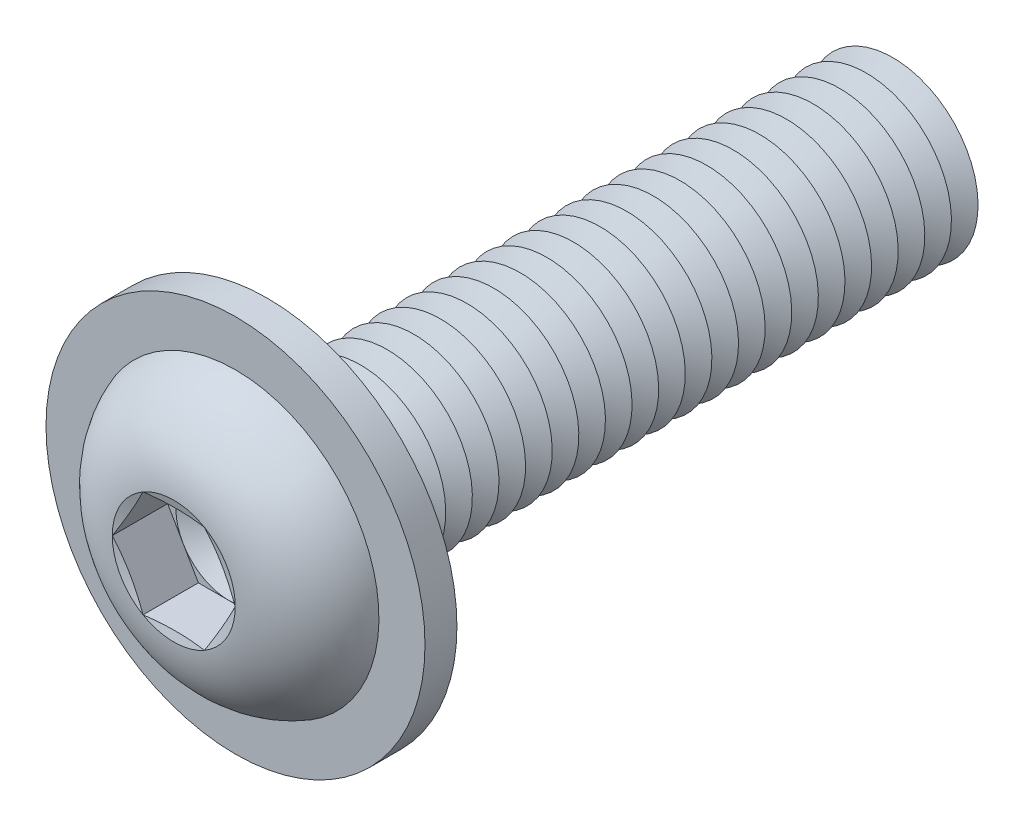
ISO-10303-21;
HEADER;
FILE_DESCRIPTION(('STEP AP214'),'2;1');
FILE_NAME('part.step','',(''),(''),'','','');
FILE_SCHEMA(('AUTOMOTIVE_DESIGN { 1 0 10303 214 1 1 1 1 }'));
ENDSEC;
DATA;
#1=APPLICATION_CONTEXT('core data for automotive mechanical design processes');
#2=APPLICATION_PROTOCOL_DEFINITION('international standard','automotive_design',2000,#1);
#3=PRODUCT_CONTEXT('',#1,'mechanical');
#4=PRODUCT('Part','Part','',(#3));
#5=PRODUCT_RELATED_PRODUCT_CATEGORY('part','',(#4));
#6=PRODUCT_DEFINITION_FORMATION('','',#4);
#7=PRODUCT_DEFINITION_CONTEXT('part definition',#1,'design');
#8=PRODUCT_DEFINITION('design','',#6,#7);
#9=PRODUCT_DEFINITION_SHAPE('','',#8);
#10=(LENGTH_UNIT() NAMED_UNIT(*) SI_UNIT(.MILLI.,.METRE.));
#11=(NAMED_UNIT(*) PLANE_ANGLE_UNIT() SI_UNIT($,.RADIAN.));
#12=(NAMED_UNIT(*) SI_UNIT($,.STERADIAN.) SOLID_ANGLE_UNIT());
#13=UNCERTAINTY_MEASURE_WITH_UNIT(LENGTH_MEASURE(1.E-05),#10,'distance_accuracy_value','');
#14=(GEOMETRIC_REPRESENTATION_CONTEXT(3) GLOBAL_UNCERTAINTY_ASSIGNED_CONTEXT((#13)) GLOBAL_UNIT_ASSIGNED_CONTEXT((#10,
#11,#12)) REPRESENTATION_CONTEXT('',''));
#15=CARTESIAN_POINT('',(0.,0.,0.));
#16=DIRECTION('',(0.,0.,1.));
#17=DIRECTION('',(1.,0.,0.));
#18=AXIS2_PLACEMENT_3D('',#15,#16,#17);
#19=CARTESIAN_POINT('',(0.,0.,-25.625));
#20=DIRECTION('',(0.,0.,1.));
#21=DIRECTION('',(0.,-1.,0.));
#22=AXIS2_PLACEMENT_3D('',#19,#20,#21);
#23=CONICAL_SURFACE('',#22,3.99999999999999,1.0471975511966);
#24=CARTESIAN_POINT('',(0.,0.,-26.25));
#25=DIRECTION('',(0.,0.,1.));
#26=DIRECTION('',(0.,-1.,0.));
#27=AXIS2_PLACEMENT_3D('',#24,#25,#26);
#28=CIRCLE('',#27,2.91746824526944);
#29=CARTESIAN_POINT('',(0.,-2.91746824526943,-26.25));
#30=VERTEX_POINT('',#29);
#31=EDGE_CURVE('E401',#30,#30,#28,.T.);
#32=ORIENTED_EDGE('',*,*,#31,.T.);
#33=EDGE_LOOP('',(#32));
#34=FACE_BOUND('',#33,.T.);
#35=CARTESIAN_POINT('',(0.,0.,-25.625));
#36=DIRECTION('',(0.,0.,1.));
#37=DIRECTION('',(0.,-1.,0.));
#38=AXIS2_PLACEMENT_3D('',#35,#36,#37);
#39=CIRCLE('',#38,3.99999999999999);
#40=CARTESIAN_POINT('',(0.,-3.99999999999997,-25.625));
#41=VERTEX_POINT('',#40);
#42=EDGE_CURVE('E397',#41,#41,#39,.T.);
#43=ORIENTED_EDGE('',*,*,#42,.F.);
#44=EDGE_LOOP('',(#43));
#45=FACE_BOUND('',#44,.T.);
#46=ADVANCED_FACE('F39',(#34,#45),#23,.T.);
#47=CARTESIAN_POINT('',(0.,0.,-26.25));
#48=DIRECTION('',(0.,0.,-1.));
#49=DIRECTION('',(0.,1.,0.));
#50=AXIS2_PLACEMENT_3D('',#47,#48,#49);
#51=CONICAL_SURFACE('',#50,2.91746824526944,1.0471975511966);
#52=CARTESIAN_POINT('',(0.,0.,-26.875));
#53=DIRECTION('',(0.,0.,1.));
#54=DIRECTION('',(0.,-1.,0.));
#55=AXIS2_PLACEMENT_3D('',#52,#53,#54);
#56=CIRCLE('',#55,3.99999999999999);
#57=CARTESIAN_POINT('',(0.,-3.99999999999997,-26.875));
#58=VERTEX_POINT('',#57);
#59=EDGE_CURVE('E405',#58,#58,#56,.T.);
#60=ORIENTED_EDGE('',*,*,#59,.T.);
#61=EDGE_LOOP('',(#60));
#62=FACE_BOUND('',#61,.T.);
#63=ORIENTED_EDGE('',*,*,#31,.F.);
#64=EDGE_LOOP('',(#63));
#65=FACE_BOUND('',#64,.T.);
#66=ADVANCED_FACE('F520',(#62,#65),#51,.T.);
#67=CARTESIAN_POINT('',(0.,4.,-30.));
#68=DIRECTION('',(0.,0.,-1.));
#69=DIRECTION('',(0.,1.,0.));
#70=AXIS2_PLACEMENT_3D('',#67,#68,#69);
#71=PLANE('',#70);
#72=CARTESIAN_POINT('',(0.,0.,-30.));
#73=DIRECTION('',(0.,0.,1.));
#74=DIRECTION('',(0.,-1.,0.));
#75=AXIS2_PLACEMENT_3D('',#72,#73,#74);
#76=CIRCLE('',#75,2.91746824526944);
#77=CARTESIAN_POINT('',(0.,-2.91746824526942,-30.));
#78=VERTEX_POINT('',#77);
#79=EDGE_CURVE('E424',#78,#78,#76,.T.);
#80=ORIENTED_EDGE('',*,*,#79,.F.);
#81=EDGE_LOOP('',(#80));
#82=FACE_BOUND('',#81,.T.);
#83=ADVANCED_FACE('F526',(#82),#71,.T.);
#84=CARTESIAN_POINT('',(0.,0.,-29.375));
#85=DIRECTION('',(0.,0.,1.));
#86=DIRECTION('',(0.,-1.,0.));
#87=AXIS2_PLACEMENT_3D('',#84,#85,#86);
#88=CONICAL_SURFACE('',#87,3.99999999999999,1.0471975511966);
#89=ORIENTED_EDGE('',*,*,#79,.T.);
#90=EDGE_LOOP('',(#89));
#91=FACE_BOUND('',#90,.T.);
#92=CARTESIAN_POINT('',(0.,0.,-29.375));
#93=DIRECTION('',(0.,0.,1.));
#94=DIRECTION('',(0.,-1.,0.));
#95=AXIS2_PLACEMENT_3D('',#92,#93,#94);
#96=CIRCLE('',#95,3.99999999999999);
#97=CARTESIAN_POINT('',(0.,-3.99999999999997,-29.375));
#98=VERTEX_POINT('',#97);
#99=EDGE_CURVE('E420',#98,#98,#96,.T.);
#100=ORIENTED_EDGE('',*,*,#99,.F.);
#101=EDGE_LOOP('',(#100));
#102=FACE_BOUND('',#101,.T.);
#103=ADVANCED_FACE('F545',(#91,#102),#88,.T.);
#104=CARTESIAN_POINT('',(0.,0.,-28.75));
#105=DIRECTION('',(0.,0.,-1.));
#106=DIRECTION('',(0.,1.,0.));
#107=AXIS2_PLACEMENT_3D('',#104,#105,#106);
#108=CONICAL_SURFACE('',#107,2.91746824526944,1.0471975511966);
#109=ORIENTED_EDGE('',*,*,#99,.T.);
#110=EDGE_LOOP('',(#109));
#111=FACE_BOUND('',#110,.T.);
#112=CARTESIAN_POINT('',(0.,0.,-28.75));
#113=DIRECTION('',(0.,0.,1.));
#114=DIRECTION('',(0.,-1.,0.));
#115=AXIS2_PLACEMENT_3D('',#112,#113,#114);
#116=CIRCLE('',#115,2.91746824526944);
#117=CARTESIAN_POINT('',(0.,-2.91746824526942,-28.75));
#118=VERTEX_POINT('',#117);
#119=EDGE_CURVE('E417',#118,#118,#116,.T.);
#120=ORIENTED_EDGE('',*,*,#119,.F.);
#121=EDGE_LOOP('',(#120));
#122=FACE_BOUND('',#121,.T.);
#123=ADVANCED_FACE('F542',(#111,#122),#108,.T.);
#124=CARTESIAN_POINT('',(0.,0.,-28.125));
#125=DIRECTION('',(0.,0.,1.));
#126=DIRECTION('',(0.,-1.,0.));
#127=AXIS2_PLACEMENT_3D('',#124,#125,#126);
#128=CONICAL_SURFACE('',#127,3.99999999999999,1.0471975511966);
#129=ORIENTED_EDGE('',*,*,#119,.T.);
#130=EDGE_LOOP('',(#129));
#131=FACE_BOUND('',#130,.T.);
#132=CARTESIAN_POINT('',(0.,0.,-28.125));
#133=DIRECTION('',(0.,0.,1.));
#134=DIRECTION('',(0.,-1.,0.));
#135=AXIS2_PLACEMENT_3D('',#132,#133,#134);
#136=CIRCLE('',#135,3.99999999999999);
#137=CARTESIAN_POINT('',(0.,-3.99999999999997,-28.125));
#138=VERTEX_POINT('',#137);
#139=EDGE_CURVE('E413',#138,#138,#136,.T.);
#140=ORIENTED_EDGE('',*,*,#139,.F.);
#141=EDGE_LOOP('',(#140));
#142=FACE_BOUND('',#141,.T.);
#143=ADVANCED_FACE('F536',(#131,#142),#128,.T.);
#144=CARTESIAN_POINT('',(0.,0.,-27.5));
#145=DIRECTION('',(0.,0.,-1.));
#146=DIRECTION('',(0.,1.,0.));
#147=AXIS2_PLACEMENT_3D('',#144,#145,#146);
#148=CONICAL_SURFACE('',#147,2.91746824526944,1.0471975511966);
#149=ORIENTED_EDGE('',*,*,#139,.T.);
#150=EDGE_LOOP('',(#149));
#151=FACE_BOUND('',#150,.T.);
#152=CARTESIAN_POINT('',(0.,0.,-27.5));
#153=DIRECTION('',(0.,0.,1.));
#154=DIRECTION('',(0.,-1.,0.));
#155=AXIS2_PLACEMENT_3D('',#152,#153,#154);
#156=CIRCLE('',#155,2.91746824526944);
#157=CARTESIAN_POINT('',(0.,-2.91746824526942,-27.5));
#158=VERTEX_POINT('',#157);
#159=EDGE_CURVE('E409',#158,#158,#156,.T.);
#160=ORIENTED_EDGE('',*,*,#159,.F.);
#161=EDGE_LOOP('',(#160));
#162=FACE_BOUND('',#161,.T.);
#163=ADVANCED_FACE('F532',(#151,#162),#148,.T.);
#164=CARTESIAN_POINT('',(0.,0.,-26.875));
#165=DIRECTION('',(0.,0.,1.));
#166=DIRECTION('',(0.,-1.,0.));
#167=AXIS2_PLACEMENT_3D('',#164,#165,#166);
#168=CONICAL_SURFACE('',#167,3.99999999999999,1.0471975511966);
#169=ORIENTED_EDGE('',*,*,#159,.T.);
#170=EDGE_LOOP('',(#169));
#171=FACE_BOUND('',#170,.T.);
#172=ORIENTED_EDGE('',*,*,#59,.F.);
#173=EDGE_LOOP('',(#172));
#174=FACE_BOUND('',#173,.T.);
#175=ADVANCED_FACE('F535',(#171,#174),#168,.T.);
#176=CARTESIAN_POINT('',(0.,0.,-24.375));
#177=DIRECTION('',(0.,0.,1.));
#178=DIRECTION('',(0.,-1.,0.));
#179=AXIS2_PLACEMENT_3D('',#176,#177,#178);
#180=CONICAL_SURFACE('',#179,3.99999999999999,1.0471975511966);
#181=CARTESIAN_POINT('',(0.,0.,-25.));
#182=DIRECTION('',(0.,0.,1.));
#183=DIRECTION('',(0.,-1.,0.));
#184=AXIS2_PLACEMENT_3D('',#181,#182,#183);
#185=CIRCLE('',#184,2.91746824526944);
#186=CARTESIAN_POINT('',(0.,-2.91746824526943,-25.));
#187=VERTEX_POINT('',#186);
#188=EDGE_CURVE('E393',#187,#187,#185,.T.);
#189=ORIENTED_EDGE('',*,*,#188,.T.);
#190=EDGE_LOOP('',(#189));
#191=FACE_BOUND('',#190,.T.);
#192=CARTESIAN_POINT('',(0.,0.,-24.375));
#193=DIRECTION('',(0.,0.,1.));
#194=DIRECTION('',(0.,-1.,0.));
#195=AXIS2_PLACEMENT_3D('',#192,#193,#194);
#196=CIRCLE('',#195,3.99999999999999);
#197=CARTESIAN_POINT('',(0.,-3.99999999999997,-24.375));
#198=VERTEX_POINT('',#197);
#199=EDGE_CURVE('E389',#198,#198,#196,.T.);
#200=ORIENTED_EDGE('',*,*,#199,.F.);
#201=EDGE_LOOP('',(#200));
#202=FACE_BOUND('',#201,.T.);
#203=ADVANCED_FACE('F540',(#191,#202),#180,.T.);
#204=CARTESIAN_POINT('',(0.,0.,-25.));
#205=DIRECTION('',(0.,0.,-1.));
#206=DIRECTION('',(0.,1.,0.));
#207=AXIS2_PLACEMENT_3D('',#204,#205,#206);
#208=CONICAL_SURFACE('',#207,2.91746824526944,1.0471975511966);
#209=ORIENTED_EDGE('',*,*,#42,.T.);
#210=EDGE_LOOP('',(#209));
#211=FACE_BOUND('',#210,.T.);
#212=ORIENTED_EDGE('',*,*,#188,.F.);
#213=EDGE_LOOP('',(#212));
#214=FACE_BOUND('',#213,.T.);
#215=ADVANCED_FACE('F591',(#211,#214),#208,.T.);
#216=CARTESIAN_POINT('',(0.,0.,-23.125));
#217=DIRECTION('',(0.,0.,1.));
#218=DIRECTION('',(0.,-1.,0.));
#219=AXIS2_PLACEMENT_3D('',#216,#217,#218);
#220=CONICAL_SURFACE('',#219,3.99999999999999,1.0471975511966);
#221=CARTESIAN_POINT('',(0.,0.,-23.75));
#222=DIRECTION('',(0.,0.,1.));
#223=DIRECTION('',(0.,-1.,0.));
#224=AXIS2_PLACEMENT_3D('',#221,#222,#223);
#225=CIRCLE('',#224,2.91746824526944);
#226=CARTESIAN_POINT('',(0.,-2.91746824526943,-23.75));
#227=VERTEX_POINT('',#226);
#228=EDGE_CURVE('E385',#227,#227,#225,.T.);
#229=ORIENTED_EDGE('',*,*,#228,.T.);
#230=EDGE_LOOP('',(#229));
#231=FACE_BOUND('',#230,.T.);
#232=CARTESIAN_POINT('',(0.,0.,-23.125));
#233=DIRECTION('',(0.,0.,1.));
#234=DIRECTION('',(0.,-1.,0.));
#235=AXIS2_PLACEMENT_3D('',#232,#233,#234);
#236=CIRCLE('',#235,3.99999999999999);
#237=CARTESIAN_POINT('',(0.,-3.99999999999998,-23.125));
#238=VERTEX_POINT('',#237);
#239=EDGE_CURVE('E381',#238,#238,#236,.T.);
#240=ORIENTED_EDGE('',*,*,#239,.F.);
#241=EDGE_LOOP('',(#240));
#242=FACE_BOUND('',#241,.T.);
#243=ADVANCED_FACE('F597',(#231,#242),#220,.T.);
#244=CARTESIAN_POINT('',(0.,0.,-23.75));
#245=DIRECTION('',(0.,0.,-1.));
#246=DIRECTION('',(0.,1.,0.));
#247=AXIS2_PLACEMENT_3D('',#244,#245,#246);
#248=CONICAL_SURFACE('',#247,2.91746824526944,1.0471975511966);
#249=ORIENTED_EDGE('',*,*,#199,.T.);
#250=EDGE_LOOP('',(#249));
#251=FACE_BOUND('',#250,.T.);
#252=ORIENTED_EDGE('',*,*,#228,.F.);
#253=EDGE_LOOP('',(#252));
#254=FACE_BOUND('',#253,.T.);
#255=ADVANCED_FACE('F604',(#251,#254),#248,.T.);
#256=CARTESIAN_POINT('',(0.,0.,-21.875));
#257=DIRECTION('',(0.,0.,1.));
#258=DIRECTION('',(0.,-1.,0.));
#259=AXIS2_PLACEMENT_3D('',#256,#257,#258);
#260=CONICAL_SURFACE('',#259,3.99999999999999,1.0471975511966);
#261=CARTESIAN_POINT('',(0.,0.,-22.5));
#262=DIRECTION('',(0.,0.,1.));
#263=DIRECTION('',(0.,-1.,0.));
#264=AXIS2_PLACEMENT_3D('',#261,#262,#263);
#265=CIRCLE('',#264,2.91746824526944);
#266=CARTESIAN_POINT('',(0.,-2.91746824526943,-22.5));
#267=VERTEX_POINT('',#266);
#268=EDGE_CURVE('E377',#267,#267,#265,.T.);
#269=ORIENTED_EDGE('',*,*,#268,.T.);
#270=EDGE_LOOP('',(#269));
#271=FACE_BOUND('',#270,.T.);
#272=CARTESIAN_POINT('',(0.,0.,-21.875));
#273=DIRECTION('',(0.,0.,1.));
#274=DIRECTION('',(0.,-1.,0.));
#275=AXIS2_PLACEMENT_3D('',#272,#273,#274);
#276=CIRCLE('',#275,3.99999999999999);
#277=CARTESIAN_POINT('',(0.,-3.99999999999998,-21.875));
#278=VERTEX_POINT('',#277);
#279=EDGE_CURVE('E373',#278,#278,#276,.T.);
#280=ORIENTED_EDGE('',*,*,#279,.F.);
#281=EDGE_LOOP('',(#280));
#282=FACE_BOUND('',#281,.T.);
#283=ADVANCED_FACE('F611',(#271,#282),#260,.T.);
#284=CARTESIAN_POINT('',(0.,0.,-22.5));
#285=DIRECTION('',(0.,0.,-1.));
#286=DIRECTION('',(0.,1.,0.));
#287=AXIS2_PLACEMENT_3D('',#284,#285,#286);
#288=CONICAL_SURFACE('',#287,2.91746824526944,1.0471975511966);
#289=ORIENTED_EDGE('',*,*,#239,.T.);
#290=EDGE_LOOP('',(#289));
#291=FACE_BOUND('',#290,.T.);
#292=ORIENTED_EDGE('',*,*,#268,.F.);
#293=EDGE_LOOP('',(#292));
#294=FACE_BOUND('',#293,.T.);
#295=ADVANCED_FACE('F618',(#291,#294),#288,.T.);
#296=CARTESIAN_POINT('',(0.,0.,-20.625));
#297=DIRECTION('',(0.,0.,1.));
#298=DIRECTION('',(0.,-1.,0.));
#299=AXIS2_PLACEMENT_3D('',#296,#297,#298);
#300=CONICAL_SURFACE('',#299,3.99999999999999,1.0471975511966);
#301=CARTESIAN_POINT('',(0.,0.,-21.25));
#302=DIRECTION('',(0.,0.,1.));
#303=DIRECTION('',(0.,-1.,0.));
#304=AXIS2_PLACEMENT_3D('',#301,#302,#303);
#305=CIRCLE('',#304,2.91746824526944);
#306=CARTESIAN_POINT('',(0.,-2.91746824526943,-21.25));
#307=VERTEX_POINT('',#306);
#308=EDGE_CURVE('E369',#307,#307,#305,.T.);
#309=ORIENTED_EDGE('',*,*,#308,.T.);
#310=EDGE_LOOP('',(#309));
#311=FACE_BOUND('',#310,.T.);
#312=CARTESIAN_POINT('',(0.,0.,-20.625));
#313=DIRECTION('',(0.,0.,1.));
#314=DIRECTION('',(0.,-1.,0.));
#315=AXIS2_PLACEMENT_3D('',#312,#313,#314);
#316=CIRCLE('',#315,3.99999999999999);
#317=CARTESIAN_POINT('',(0.,-3.99999999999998,-20.625));
#318=VERTEX_POINT('',#317);
#319=EDGE_CURVE('E365',#318,#318,#316,.T.);
#320=ORIENTED_EDGE('',*,*,#319,.F.);
#321=EDGE_LOOP('',(#320));
#322=FACE_BOUND('',#321,.T.);
#323=ADVANCED_FACE('F625',(#311,#322),#300,.T.);
#324=CARTESIAN_POINT('',(0.,0.,-21.25));
#325=DIRECTION('',(0.,0.,-1.));
#326=DIRECTION('',(0.,1.,0.));
#327=AXIS2_PLACEMENT_3D('',#324,#325,#326);
#328=CONICAL_SURFACE('',#327,2.91746824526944,1.0471975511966);
#329=ORIENTED_EDGE('',*,*,#279,.T.);
#330=EDGE_LOOP('',(#329));
#331=FACE_BOUND('',#330,.T.);
#332=ORIENTED_EDGE('',*,*,#308,.F.);
#333=EDGE_LOOP('',(#332));
#334=FACE_BOUND('',#333,.T.);
#335=ADVANCED_FACE('F632',(#331,#334),#328,.T.);
#336=CARTESIAN_POINT('',(0.,0.,-19.375));
#337=DIRECTION('',(0.,0.,1.));
#338=DIRECTION('',(0.,-1.,0.));
#339=AXIS2_PLACEMENT_3D('',#336,#337,#338);
#340=CONICAL_SURFACE('',#339,3.99999999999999,1.0471975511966);
#341=CARTESIAN_POINT('',(0.,0.,-20.));
#342=DIRECTION('',(0.,0.,1.));
#343=DIRECTION('',(0.,-1.,0.));
#344=AXIS2_PLACEMENT_3D('',#341,#342,#343);
#345=CIRCLE('',#344,2.91746824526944);
#346=CARTESIAN_POINT('',(0.,-2.91746824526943,-20.));
#347=VERTEX_POINT('',#346);
#348=EDGE_CURVE('E361',#347,#347,#345,.T.);
#349=ORIENTED_EDGE('',*,*,#348,.T.);
#350=EDGE_LOOP('',(#349));
#351=FACE_BOUND('',#350,.T.);
#352=CARTESIAN_POINT('',(0.,0.,-19.375));
#353=DIRECTION('',(0.,0.,1.));
#354=DIRECTION('',(0.,-1.,0.));
#355=AXIS2_PLACEMENT_3D('',#352,#353,#354);
#356=CIRCLE('',#355,3.99999999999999);
#357=CARTESIAN_POINT('',(0.,-3.99999999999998,-19.375));
#358=VERTEX_POINT('',#357);
#359=EDGE_CURVE('E357',#358,#358,#356,.T.);
#360=ORIENTED_EDGE('',*,*,#359,.F.);
#361=EDGE_LOOP('',(#360));
#362=FACE_BOUND('',#361,.T.);
#363=ADVANCED_FACE('F639',(#351,#362),#340,.T.);
#364=CARTESIAN_POINT('',(0.,0.,-20.));
#365=DIRECTION('',(0.,0.,-1.));
#366=DIRECTION('',(0.,1.,0.));
#367=AXIS2_PLACEMENT_3D('',#364,#365,#366);
#368=CONICAL_SURFACE('',#367,2.91746824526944,1.0471975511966);
#369=ORIENTED_EDGE('',*,*,#319,.T.);
#370=EDGE_LOOP('',(#369));
#371=FACE_BOUND('',#370,.T.);
#372=ORIENTED_EDGE('',*,*,#348,.F.);
#373=EDGE_LOOP('',(#372));
#374=FACE_BOUND('',#373,.T.);
#375=ADVANCED_FACE('F646',(#371,#374),#368,.T.);
#376=CARTESIAN_POINT('',(0.,0.,-18.125));
#377=DIRECTION('',(0.,0.,1.));
#378=DIRECTION('',(0.,-1.,0.));
#379=AXIS2_PLACEMENT_3D('',#376,#377,#378);
#380=CONICAL_SURFACE('',#379,3.99999999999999,1.0471975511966);
#381=CARTESIAN_POINT('',(0.,0.,-18.75));
#382=DIRECTION('',(0.,0.,1.));
#383=DIRECTION('',(0.,-1.,0.));
#384=AXIS2_PLACEMENT_3D('',#381,#382,#383);
#385=CIRCLE('',#384,2.91746824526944);
#386=CARTESIAN_POINT('',(0.,-2.91746824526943,-18.75));
#387=VERTEX_POINT('',#386);
#388=EDGE_CURVE('E353',#387,#387,#385,.T.);
#389=ORIENTED_EDGE('',*,*,#388,.T.);
#390=EDGE_LOOP('',(#389));
#391=FACE_BOUND('',#390,.T.);
#392=CARTESIAN_POINT('',(0.,0.,-18.125));
#393=DIRECTION('',(0.,0.,1.));
#394=DIRECTION('',(0.,-1.,0.));
#395=AXIS2_PLACEMENT_3D('',#392,#393,#394);
#396=CIRCLE('',#395,3.99999999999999);
#397=CARTESIAN_POINT('',(0.,-3.99999999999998,-18.125));
#398=VERTEX_POINT('',#397);
#399=EDGE_CURVE('E349',#398,#398,#396,.T.);
#400=ORIENTED_EDGE('',*,*,#399,.F.);
#401=EDGE_LOOP('',(#400));
#402=FACE_BOUND('',#401,.T.);
#403=ADVANCED_FACE('F653',(#391,#402),#380,.T.);
#404=CARTESIAN_POINT('',(0.,0.,-18.75));
#405=DIRECTION('',(0.,0.,-1.));
#406=DIRECTION('',(0.,1.,0.));
#407=AXIS2_PLACEMENT_3D('',#404,#405,#406);
#408=CONICAL_SURFACE('',#407,2.91746824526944,1.0471975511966);
#409=ORIENTED_EDGE('',*,*,#359,.T.);
#410=EDGE_LOOP('',(#409));
#411=FACE_BOUND('',#410,.T.);
#412=ORIENTED_EDGE('',*,*,#388,.F.);
#413=EDGE_LOOP('',(#412));
#414=FACE_BOUND('',#413,.T.);
#415=ADVANCED_FACE('F660',(#411,#414),#408,.T.);
#416=CARTESIAN_POINT('',(0.,0.,-16.875));
#417=DIRECTION('',(0.,0.,1.));
#418=DIRECTION('',(0.,-1.,0.));
#419=AXIS2_PLACEMENT_3D('',#416,#417,#418);
#420=CONICAL_SURFACE('',#419,3.99999999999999,1.0471975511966);
#421=CARTESIAN_POINT('',(0.,0.,-17.5));
#422=DIRECTION('',(0.,0.,1.));
#423=DIRECTION('',(0.,-1.,0.));
#424=AXIS2_PLACEMENT_3D('',#421,#422,#423);
#425=CIRCLE('',#424,2.91746824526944);
#426=CARTESIAN_POINT('',(0.,-2.91746824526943,-17.5));
#427=VERTEX_POINT('',#426);
#428=EDGE_CURVE('E345',#427,#427,#425,.T.);
#429=ORIENTED_EDGE('',*,*,#428,.T.);
#430=EDGE_LOOP('',(#429));
#431=FACE_BOUND('',#430,.T.);
#432=CARTESIAN_POINT('',(0.,0.,-16.875));
#433=DIRECTION('',(0.,0.,1.));
#434=DIRECTION('',(0.,-1.,0.));
#435=AXIS2_PLACEMENT_3D('',#432,#433,#434);
#436=CIRCLE('',#435,3.99999999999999);
#437=CARTESIAN_POINT('',(0.,-3.99999999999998,-16.875));
#438=VERTEX_POINT('',#437);
#439=EDGE_CURVE('E341',#438,#438,#436,.T.);
#440=ORIENTED_EDGE('',*,*,#439,.F.);
#441=EDGE_LOOP('',(#440));
#442=FACE_BOUND('',#441,.T.);
#443=ADVANCED_FACE('F667',(#431,#442),#420,.T.);
#444=CARTESIAN_POINT('',(0.,0.,-17.5));
#445=DIRECTION('',(0.,0.,-1.));
#446=DIRECTION('',(0.,1.,0.));
#447=AXIS2_PLACEMENT_3D('',#444,#445,#446);
#448=CONICAL_SURFACE('',#447,2.91746824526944,1.0471975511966);
#449=ORIENTED_EDGE('',*,*,#399,.T.);
#450=EDGE_LOOP('',(#449));
#451=FACE_BOUND('',#450,.T.);
#452=ORIENTED_EDGE('',*,*,#428,.F.);
#453=EDGE_LOOP('',(#452));
#454=FACE_BOUND('',#453,.T.);
#455=ADVANCED_FACE('F674',(#451,#454),#448,.T.);
#456=CARTESIAN_POINT('',(0.,0.,-15.625));
#457=DIRECTION('',(0.,0.,1.));
#458=DIRECTION('',(0.,-1.,0.));
#459=AXIS2_PLACEMENT_3D('',#456,#457,#458);
#460=CONICAL_SURFACE('',#459,3.99999999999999,1.0471975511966);
#461=CARTESIAN_POINT('',(0.,0.,-16.25));
#462=DIRECTION('',(0.,0.,1.));
#463=DIRECTION('',(0.,-1.,0.));
#464=AXIS2_PLACEMENT_3D('',#461,#462,#463);
#465=CIRCLE('',#464,2.91746824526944);
#466=CARTESIAN_POINT('',(0.,-2.91746824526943,-16.25));
#467=VERTEX_POINT('',#466);
#468=EDGE_CURVE('E337',#467,#467,#465,.T.);
#469=ORIENTED_EDGE('',*,*,#468,.T.);
#470=EDGE_LOOP('',(#469));
#471=FACE_BOUND('',#470,.T.);
#472=CARTESIAN_POINT('',(0.,0.,-15.625));
#473=DIRECTION('',(0.,0.,1.));
#474=DIRECTION('',(0.,-1.,0.));
#475=AXIS2_PLACEMENT_3D('',#472,#473,#474);
#476=CIRCLE('',#475,3.99999999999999);
#477=CARTESIAN_POINT('',(0.,-3.99999999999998,-15.625));
#478=VERTEX_POINT('',#477);
#479=EDGE_CURVE('E333',#478,#478,#476,.T.);
#480=ORIENTED_EDGE('',*,*,#479,.F.);
#481=EDGE_LOOP('',(#480));
#482=FACE_BOUND('',#481,.T.);
#483=ADVANCED_FACE('F681',(#471,#482),#460,.T.);
#484=CARTESIAN_POINT('',(0.,0.,-16.25));
#485=DIRECTION('',(0.,0.,-1.));
#486=DIRECTION('',(0.,1.,0.));
#487=AXIS2_PLACEMENT_3D('',#484,#485,#486);
#488=CONICAL_SURFACE('',#487,2.91746824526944,1.0471975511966);
#489=ORIENTED_EDGE('',*,*,#439,.T.);
#490=EDGE_LOOP('',(#489));
#491=FACE_BOUND('',#490,.T.);
#492=ORIENTED_EDGE('',*,*,#468,.F.);
#493=EDGE_LOOP('',(#492));
#494=FACE_BOUND('',#493,.T.);
#495=ADVANCED_FACE('F688',(#491,#494),#488,.T.);
#496=CARTESIAN_POINT('',(0.,0.,-14.375));
#497=DIRECTION('',(0.,0.,1.));
#498=DIRECTION('',(0.,-1.,0.));
#499=AXIS2_PLACEMENT_3D('',#496,#497,#498);
#500=CONICAL_SURFACE('',#499,3.99999999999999,1.0471975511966);
#501=CARTESIAN_POINT('',(0.,0.,-15.));
#502=DIRECTION('',(0.,0.,1.));
#503=DIRECTION('',(0.,-1.,0.));
#504=AXIS2_PLACEMENT_3D('',#501,#502,#503);
#505=CIRCLE('',#504,2.91746824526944);
#506=CARTESIAN_POINT('',(0.,-2.91746824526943,-15.));
#507=VERTEX_POINT('',#506);
#508=EDGE_CURVE('E329',#507,#507,#505,.T.);
#509=ORIENTED_EDGE('',*,*,#508,.T.);
#510=EDGE_LOOP('',(#509));
#511=FACE_BOUND('',#510,.T.);
#512=CARTESIAN_POINT('',(0.,0.,-14.375));
#513=DIRECTION('',(0.,0.,1.));
#514=DIRECTION('',(0.,-1.,0.));
#515=AXIS2_PLACEMENT_3D('',#512,#513,#514);
#516=CIRCLE('',#515,3.99999999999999);
#517=CARTESIAN_POINT('',(0.,-3.99999999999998,-14.375));
#518=VERTEX_POINT('',#517);
#519=EDGE_CURVE('E325',#518,#518,#516,.T.);
#520=ORIENTED_EDGE('',*,*,#519,.F.);
#521=EDGE_LOOP('',(#520));
#522=FACE_BOUND('',#521,.T.);
#523=ADVANCED_FACE('F695',(#511,#522),#500,.T.);
#524=CARTESIAN_POINT('',(0.,0.,-15.));
#525=DIRECTION('',(0.,0.,-1.));
#526=DIRECTION('',(0.,1.,0.));
#527=AXIS2_PLACEMENT_3D('',#524,#525,#526);
#528=CONICAL_SURFACE('',#527,2.91746824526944,1.0471975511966);
#529=ORIENTED_EDGE('',*,*,#479,.T.);
#530=EDGE_LOOP('',(#529));
#531=FACE_BOUND('',#530,.T.);
#532=ORIENTED_EDGE('',*,*,#508,.F.);
#533=EDGE_LOOP('',(#532));
#534=FACE_BOUND('',#533,.T.);
#535=ADVANCED_FACE('F702',(#531,#534),#528,.T.);
#536=CARTESIAN_POINT('',(0.,0.,-13.125));
#537=DIRECTION('',(0.,0.,1.));
#538=DIRECTION('',(0.,-1.,0.));
#539=AXIS2_PLACEMENT_3D('',#536,#537,#538);
#540=CONICAL_SURFACE('',#539,3.99999999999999,1.0471975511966);
#541=CARTESIAN_POINT('',(0.,0.,-13.75));
#542=DIRECTION('',(0.,0.,1.));
#543=DIRECTION('',(0.,-1.,0.));
#544=AXIS2_PLACEMENT_3D('',#541,#542,#543);
#545=CIRCLE('',#544,2.91746824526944);
#546=CARTESIAN_POINT('',(0.,-2.91746824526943,-13.75));
#547=VERTEX_POINT('',#546);
#548=EDGE_CURVE('E321',#547,#547,#545,.T.);
#549=ORIENTED_EDGE('',*,*,#548,.T.);
#550=EDGE_LOOP('',(#549));
#551=FACE_BOUND('',#550,.T.);
#552=CARTESIAN_POINT('',(0.,0.,-13.125));
#553=DIRECTION('',(0.,0.,1.));
#554=DIRECTION('',(0.,-1.,0.));
#555=AXIS2_PLACEMENT_3D('',#552,#553,#554);
#556=CIRCLE('',#555,3.99999999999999);
#557=CARTESIAN_POINT('',(0.,-3.99999999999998,-13.125));
#558=VERTEX_POINT('',#557);
#559=EDGE_CURVE('E317',#558,#558,#556,.T.);
#560=ORIENTED_EDGE('',*,*,#559,.F.);
#561=EDGE_LOOP('',(#560));
#562=FACE_BOUND('',#561,.T.);
#563=ADVANCED_FACE('F709',(#551,#562),#540,.T.);
#564=CARTESIAN_POINT('',(0.,0.,-13.75));
#565=DIRECTION('',(0.,0.,-1.));
#566=DIRECTION('',(0.,1.,0.));
#567=AXIS2_PLACEMENT_3D('',#564,#565,#566);
#568=CONICAL_SURFACE('',#567,2.91746824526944,1.0471975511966);
#569=ORIENTED_EDGE('',*,*,#519,.T.);
#570=EDGE_LOOP('',(#569));
#571=FACE_BOUND('',#570,.T.);
#572=ORIENTED_EDGE('',*,*,#548,.F.);
#573=EDGE_LOOP('',(#572));
#574=FACE_BOUND('',#573,.T.);
#575=ADVANCED_FACE('F716',(#571,#574),#568,.T.);
#576=CARTESIAN_POINT('',(0.,0.,-11.875));
#577=DIRECTION('',(0.,0.,1.));
#578=DIRECTION('',(0.,-1.,0.));
#579=AXIS2_PLACEMENT_3D('',#576,#577,#578);
#580=CONICAL_SURFACE('',#579,3.99999999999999,1.0471975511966);
#581=CARTESIAN_POINT('',(0.,0.,-12.5));
#582=DIRECTION('',(0.,0.,1.));
#583=DIRECTION('',(0.,-1.,0.));
#584=AXIS2_PLACEMENT_3D('',#581,#582,#583);
#585=CIRCLE('',#584,2.91746824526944);
#586=CARTESIAN_POINT('',(0.,-2.91746824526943,-12.5));
#587=VERTEX_POINT('',#586);
#588=EDGE_CURVE('E313',#587,#587,#585,.T.);
#589=ORIENTED_EDGE('',*,*,#588,.T.);
#590=EDGE_LOOP('',(#589));
#591=FACE_BOUND('',#590,.T.);
#592=CARTESIAN_POINT('',(0.,0.,-11.875));
#593=DIRECTION('',(0.,0.,1.));
#594=DIRECTION('',(0.,-1.,0.));
#595=AXIS2_PLACEMENT_3D('',#592,#593,#594);
#596=CIRCLE('',#595,3.99999999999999);
#597=CARTESIAN_POINT('',(0.,-3.99999999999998,-11.875));
#598=VERTEX_POINT('',#597);
#599=EDGE_CURVE('E309',#598,#598,#596,.T.);
#600=ORIENTED_EDGE('',*,*,#599,.F.);
#601=EDGE_LOOP('',(#600));
#602=FACE_BOUND('',#601,.T.);
#603=ADVANCED_FACE('F723',(#591,#602),#580,.T.);
#604=CARTESIAN_POINT('',(0.,0.,-12.5));
#605=DIRECTION('',(0.,0.,-1.));
#606=DIRECTION('',(0.,1.,0.));
#607=AXIS2_PLACEMENT_3D('',#604,#605,#606);
#608=CONICAL_SURFACE('',#607,2.91746824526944,1.0471975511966);
#609=ORIENTED_EDGE('',*,*,#559,.T.);
#610=EDGE_LOOP('',(#609));
#611=FACE_BOUND('',#610,.T.);
#612=ORIENTED_EDGE('',*,*,#588,.F.);
#613=EDGE_LOOP('',(#612));
#614=FACE_BOUND('',#613,.T.);
#615=ADVANCED_FACE('F730',(#611,#614),#608,.T.);
#616=CARTESIAN_POINT('',(0.,0.,-10.625));
#617=DIRECTION('',(0.,0.,1.));
#618=DIRECTION('',(0.,-1.,0.));
#619=AXIS2_PLACEMENT_3D('',#616,#617,#618);
#620=CONICAL_SURFACE('',#619,3.99999999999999,1.0471975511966);
#621=CARTESIAN_POINT('',(0.,0.,-11.25));
#622=DIRECTION('',(0.,0.,1.));
#623=DIRECTION('',(0.,-1.,0.));
#624=AXIS2_PLACEMENT_3D('',#621,#622,#623);
#625=CIRCLE('',#624,2.91746824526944);
#626=CARTESIAN_POINT('',(0.,-2.91746824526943,-11.25));
#627=VERTEX_POINT('',#626);
#628=EDGE_CURVE('E305',#627,#627,#625,.T.);
#629=ORIENTED_EDGE('',*,*,#628,.T.);
#630=EDGE_LOOP('',(#629));
#631=FACE_BOUND('',#630,.T.);
#632=CARTESIAN_POINT('',(0.,0.,-10.625));
#633=DIRECTION('',(0.,0.,1.));
#634=DIRECTION('',(0.,-1.,0.));
#635=AXIS2_PLACEMENT_3D('',#632,#633,#634);
#636=CIRCLE('',#635,3.99999999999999);
#637=CARTESIAN_POINT('',(0.,-3.99999999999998,-10.625));
#638=VERTEX_POINT('',#637);
#639=EDGE_CURVE('E301',#638,#638,#636,.T.);
#640=ORIENTED_EDGE('',*,*,#639,.F.);
#641=EDGE_LOOP('',(#640));
#642=FACE_BOUND('',#641,.T.);
#643=ADVANCED_FACE('F737',(#631,#642),#620,.T.);
#644=CARTESIAN_POINT('',(0.,0.,-11.25));
#645=DIRECTION('',(0.,0.,-1.));
#646=DIRECTION('',(0.,1.,0.));
#647=AXIS2_PLACEMENT_3D('',#644,#645,#646);
#648=CONICAL_SURFACE('',#647,2.91746824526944,1.0471975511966);
#649=ORIENTED_EDGE('',*,*,#599,.T.);
#650=EDGE_LOOP('',(#649));
#651=FACE_BOUND('',#650,.T.);
#652=ORIENTED_EDGE('',*,*,#628,.F.);
#653=EDGE_LOOP('',(#652));
#654=FACE_BOUND('',#653,.T.);
#655=ADVANCED_FACE('F744',(#651,#654),#648,.T.);
#656=CARTESIAN_POINT('',(0.,0.,-9.375));
#657=DIRECTION('',(0.,0.,1.));
#658=DIRECTION('',(0.,-1.,0.));
#659=AXIS2_PLACEMENT_3D('',#656,#657,#658);
#660=CONICAL_SURFACE('',#659,3.99999999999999,1.0471975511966);
#661=CARTESIAN_POINT('',(0.,0.,-10.));
#662=DIRECTION('',(0.,0.,1.));
#663=DIRECTION('',(0.,-1.,0.));
#664=AXIS2_PLACEMENT_3D('',#661,#662,#663);
#665=CIRCLE('',#664,2.91746824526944);
#666=CARTESIAN_POINT('',(0.,-2.91746824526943,-10.));
#667=VERTEX_POINT('',#666);
#668=EDGE_CURVE('E297',#667,#667,#665,.T.);
#669=ORIENTED_EDGE('',*,*,#668,.T.);
#670=EDGE_LOOP('',(#669));
#671=FACE_BOUND('',#670,.T.);
#672=CARTESIAN_POINT('',(0.,0.,-9.375));
#673=DIRECTION('',(0.,0.,1.));
#674=DIRECTION('',(0.,-1.,0.));
#675=AXIS2_PLACEMENT_3D('',#672,#673,#674);
#676=CIRCLE('',#675,3.99999999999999);
#677=CARTESIAN_POINT('',(0.,-3.99999999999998,-9.375));
#678=VERTEX_POINT('',#677);
#679=EDGE_CURVE('E293',#678,#678,#676,.T.);
#680=ORIENTED_EDGE('',*,*,#679,.F.);
#681=EDGE_LOOP('',(#680));
#682=FACE_BOUND('',#681,.T.);
#683=ADVANCED_FACE('F751',(#671,#682),#660,.T.);
#684=CARTESIAN_POINT('',(0.,0.,-10.));
#685=DIRECTION('',(0.,0.,-1.));
#686=DIRECTION('',(0.,1.,0.));
#687=AXIS2_PLACEMENT_3D('',#684,#685,#686);
#688=CONICAL_SURFACE('',#687,2.91746824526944,1.0471975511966);
#689=ORIENTED_EDGE('',*,*,#639,.T.);
#690=EDGE_LOOP('',(#689));
#691=FACE_BOUND('',#690,.T.);
#692=ORIENTED_EDGE('',*,*,#668,.F.);
#693=EDGE_LOOP('',(#692));
#694=FACE_BOUND('',#693,.T.);
#695=ADVANCED_FACE('F758',(#691,#694),#688,.T.);
#696=CARTESIAN_POINT('',(0.,0.,-8.125));
#697=DIRECTION('',(0.,0.,1.));
#698=DIRECTION('',(0.,-1.,0.));
#699=AXIS2_PLACEMENT_3D('',#696,#697,#698);
#700=CONICAL_SURFACE('',#699,3.99999999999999,1.0471975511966);
#701=CARTESIAN_POINT('',(0.,0.,-8.75));
#702=DIRECTION('',(0.,0.,1.));
#703=DIRECTION('',(0.,-1.,0.));
#704=AXIS2_PLACEMENT_3D('',#701,#702,#703);
#705=CIRCLE('',#704,2.91746824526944);
#706=CARTESIAN_POINT('',(0.,-2.91746824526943,-8.75));
#707=VERTEX_POINT('',#706);
#708=EDGE_CURVE('E289',#707,#707,#705,.T.);
#709=ORIENTED_EDGE('',*,*,#708,.T.);
#710=EDGE_LOOP('',(#709));
#711=FACE_BOUND('',#710,.T.);
#712=CARTESIAN_POINT('',(0.,0.,-8.125));
#713=DIRECTION('',(0.,0.,1.));
#714=DIRECTION('',(0.,-1.,0.));
#715=AXIS2_PLACEMENT_3D('',#712,#713,#714);
#716=CIRCLE('',#715,3.99999999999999);
#717=CARTESIAN_POINT('',(0.,-3.99999999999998,-8.12500000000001));
#718=VERTEX_POINT('',#717);
#719=EDGE_CURVE('E285',#718,#718,#716,.T.);
#720=ORIENTED_EDGE('',*,*,#719,.F.);
#721=EDGE_LOOP('',(#720));
#722=FACE_BOUND('',#721,.T.);
#723=ADVANCED_FACE('F765',(#711,#722),#700,.T.);
#724=CARTESIAN_POINT('',(0.,0.,-8.75));
#725=DIRECTION('',(0.,0.,-1.));
#726=DIRECTION('',(0.,1.,0.));
#727=AXIS2_PLACEMENT_3D('',#724,#725,#726);
#728=CONICAL_SURFACE('',#727,2.91746824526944,1.0471975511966);
#729=ORIENTED_EDGE('',*,*,#679,.T.);
#730=EDGE_LOOP('',(#729));
#731=FACE_BOUND('',#730,.T.);
#732=ORIENTED_EDGE('',*,*,#708,.F.);
#733=EDGE_LOOP('',(#732));
#734=FACE_BOUND('',#733,.T.);
#735=ADVANCED_FACE('F772',(#731,#734),#728,.T.);
#736=CARTESIAN_POINT('',(0.,0.,-6.875));
#737=DIRECTION('',(0.,0.,1.));
#738=DIRECTION('',(0.,-1.,0.));
#739=AXIS2_PLACEMENT_3D('',#736,#737,#738);
#740=CONICAL_SURFACE('',#739,3.99999999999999,1.0471975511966);
#741=CARTESIAN_POINT('',(0.,0.,-7.5));
#742=DIRECTION('',(0.,0.,1.));
#743=DIRECTION('',(0.,-1.,0.));
#744=AXIS2_PLACEMENT_3D('',#741,#742,#743);
#745=CIRCLE('',#744,2.91746824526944);
#746=CARTESIAN_POINT('',(0.,-2.91746824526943,-7.5));
#747=VERTEX_POINT('',#746);
#748=EDGE_CURVE('E281',#747,#747,#745,.T.);
#749=ORIENTED_EDGE('',*,*,#748,.T.);
#750=EDGE_LOOP('',(#749));
#751=FACE_BOUND('',#750,.T.);
#752=CARTESIAN_POINT('',(0.,0.,-6.875));
#753=DIRECTION('',(0.,0.,1.));
#754=DIRECTION('',(0.,-1.,0.));
#755=AXIS2_PLACEMENT_3D('',#752,#753,#754);
#756=CIRCLE('',#755,3.99999999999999);
#757=CARTESIAN_POINT('',(0.,-3.99999999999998,-6.875));
#758=VERTEX_POINT('',#757);
#759=EDGE_CURVE('E277',#758,#758,#756,.T.);
#760=ORIENTED_EDGE('',*,*,#759,.F.);
#761=EDGE_LOOP('',(#760));
#762=FACE_BOUND('',#761,.T.);
#763=ADVANCED_FACE('F779',(#751,#762),#740,.T.);
#764=CARTESIAN_POINT('',(0.,0.,-7.5));
#765=DIRECTION('',(0.,0.,-1.));
#766=DIRECTION('',(0.,1.,0.));
#767=AXIS2_PLACEMENT_3D('',#764,#765,#766);
#768=CONICAL_SURFACE('',#767,2.91746824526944,1.0471975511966);
#769=ORIENTED_EDGE('',*,*,#719,.T.);
#770=EDGE_LOOP('',(#769));
#771=FACE_BOUND('',#770,.T.);
#772=ORIENTED_EDGE('',*,*,#748,.F.);
#773=EDGE_LOOP('',(#772));
#774=FACE_BOUND('',#773,.T.);
#775=ADVANCED_FACE('F786',(#771,#774),#768,.T.);
#776=CARTESIAN_POINT('',(0.,0.,-5.625));
#777=DIRECTION('',(0.,0.,1.));
#778=DIRECTION('',(0.,-1.,0.));
#779=AXIS2_PLACEMENT_3D('',#776,#777,#778);
#780=CONICAL_SURFACE('',#779,3.99999999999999,1.0471975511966);
#781=CARTESIAN_POINT('',(0.,0.,-6.25));
#782=DIRECTION('',(0.,0.,1.));
#783=DIRECTION('',(0.,-1.,0.));
#784=AXIS2_PLACEMENT_3D('',#781,#782,#783);
#785=CIRCLE('',#784,2.91746824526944);
#786=CARTESIAN_POINT('',(0.,-2.91746824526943,-6.25));
#787=VERTEX_POINT('',#786);
#788=EDGE_CURVE('E273',#787,#787,#785,.T.);
#789=ORIENTED_EDGE('',*,*,#788,.T.);
#790=EDGE_LOOP('',(#789));
#791=FACE_BOUND('',#790,.T.);
#792=CARTESIAN_POINT('',(0.,0.,-5.625));
#793=DIRECTION('',(0.,0.,1.));
#794=DIRECTION('',(0.,-1.,0.));
#795=AXIS2_PLACEMENT_3D('',#792,#793,#794);
#796=CIRCLE('',#795,3.99999999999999);
#797=CARTESIAN_POINT('',(0.,-3.99999999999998,-5.625));
#798=VERTEX_POINT('',#797);
#799=EDGE_CURVE('E269',#798,#798,#796,.T.);
#800=ORIENTED_EDGE('',*,*,#799,.F.);
#801=EDGE_LOOP('',(#800));
#802=FACE_BOUND('',#801,.T.);
#803=ADVANCED_FACE('F793',(#791,#802),#780,.T.);
#804=CARTESIAN_POINT('',(0.,0.,-6.25));
#805=DIRECTION('',(0.,0.,-1.));
#806=DIRECTION('',(0.,1.,0.));
#807=AXIS2_PLACEMENT_3D('',#804,#805,#806);
#808=CONICAL_SURFACE('',#807,2.91746824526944,1.0471975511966);
#809=ORIENTED_EDGE('',*,*,#759,.T.);
#810=EDGE_LOOP('',(#809));
#811=FACE_BOUND('',#810,.T.);
#812=ORIENTED_EDGE('',*,*,#788,.F.);
#813=EDGE_LOOP('',(#812));
#814=FACE_BOUND('',#813,.T.);
#815=ADVANCED_FACE('F800',(#811,#814),#808,.T.);
#816=CARTESIAN_POINT('',(0.,0.,-4.375));
#817=DIRECTION('',(0.,0.,1.));
#818=DIRECTION('',(0.,-1.,0.));
#819=AXIS2_PLACEMENT_3D('',#816,#817,#818);
#820=CONICAL_SURFACE('',#819,3.99999999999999,1.0471975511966);
#821=CARTESIAN_POINT('',(0.,0.,-5.));
#822=DIRECTION('',(0.,0.,1.));
#823=DIRECTION('',(0.,-1.,0.));
#824=AXIS2_PLACEMENT_3D('',#821,#822,#823);
#825=CIRCLE('',#824,2.91746824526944);
#826=CARTESIAN_POINT('',(0.,-2.91746824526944,-5.));
#827=VERTEX_POINT('',#826);
#828=EDGE_CURVE('E265',#827,#827,#825,.T.);
#829=ORIENTED_EDGE('',*,*,#828,.T.);
#830=EDGE_LOOP('',(#829));
#831=FACE_BOUND('',#830,.T.);
#832=CARTESIAN_POINT('',(0.,0.,-4.375));
#833=DIRECTION('',(0.,0.,1.));
#834=DIRECTION('',(0.,-1.,0.));
#835=AXIS2_PLACEMENT_3D('',#832,#833,#834);
#836=CIRCLE('',#835,3.99999999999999);
#837=CARTESIAN_POINT('',(0.,-3.99999999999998,-4.37500000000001));
#838=VERTEX_POINT('',#837);
#839=EDGE_CURVE('E261',#838,#838,#836,.T.);
#840=ORIENTED_EDGE('',*,*,#839,.F.);
#841=EDGE_LOOP('',(#840));
#842=FACE_BOUND('',#841,.T.);
#843=ADVANCED_FACE('F807',(#831,#842),#820,.T.);
#844=CARTESIAN_POINT('',(0.,0.,-5.));
#845=DIRECTION('',(0.,0.,-1.));
#846=DIRECTION('',(0.,1.,0.));
#847=AXIS2_PLACEMENT_3D('',#844,#845,#846);
#848=CONICAL_SURFACE('',#847,2.91746824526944,1.0471975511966);
#849=ORIENTED_EDGE('',*,*,#799,.T.);
#850=EDGE_LOOP('',(#849));
#851=FACE_BOUND('',#850,.T.);
#852=ORIENTED_EDGE('',*,*,#828,.F.);
#853=EDGE_LOOP('',(#852));
#854=FACE_BOUND('',#853,.T.);
#855=ADVANCED_FACE('F814',(#851,#854),#848,.T.);
#856=CARTESIAN_POINT('',(0.,0.,-3.125));
#857=DIRECTION('',(0.,0.,1.));
#858=DIRECTION('',(0.,-1.,0.));
#859=AXIS2_PLACEMENT_3D('',#856,#857,#858);
#860=CONICAL_SURFACE('',#859,3.99999999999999,1.0471975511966);
#861=CARTESIAN_POINT('',(0.,0.,-3.75));
#862=DIRECTION('',(0.,0.,1.));
#863=DIRECTION('',(0.,-1.,0.));
#864=AXIS2_PLACEMENT_3D('',#861,#862,#863);
#865=CIRCLE('',#864,2.91746824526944);
#866=CARTESIAN_POINT('',(0.,-2.91746824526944,-3.75));
#867=VERTEX_POINT('',#866);
#868=EDGE_CURVE('E257',#867,#867,#865,.T.);
#869=ORIENTED_EDGE('',*,*,#868,.T.);
#870=EDGE_LOOP('',(#869));
#871=FACE_BOUND('',#870,.T.);
#872=CARTESIAN_POINT('',(0.,0.,-3.125));
#873=DIRECTION('',(0.,0.,1.));
#874=DIRECTION('',(0.,-1.,0.));
#875=AXIS2_PLACEMENT_3D('',#872,#873,#874);
#876=CIRCLE('',#875,3.99999999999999);
#877=CARTESIAN_POINT('',(0.,-3.99999999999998,-3.125));
#878=VERTEX_POINT('',#877);
#879=EDGE_CURVE('E253',#878,#878,#876,.T.);
#880=ORIENTED_EDGE('',*,*,#879,.F.);
#881=EDGE_LOOP('',(#880));
#882=FACE_BOUND('',#881,.T.);
#883=ADVANCED_FACE('F821',(#871,#882),#860,.T.);
#884=CARTESIAN_POINT('',(0.,0.,-3.75));
#885=DIRECTION('',(0.,0.,-1.));
#886=DIRECTION('',(0.,1.,0.));
#887=AXIS2_PLACEMENT_3D('',#884,#885,#886);
#888=CONICAL_SURFACE('',#887,2.91746824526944,1.0471975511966);
#889=ORIENTED_EDGE('',*,*,#839,.T.);
#890=EDGE_LOOP('',(#889));
#891=FACE_BOUND('',#890,.T.);
#892=ORIENTED_EDGE('',*,*,#868,.F.);
#893=EDGE_LOOP('',(#892));
#894=FACE_BOUND('',#893,.T.);
#895=ADVANCED_FACE('F828',(#891,#894),#888,.T.);
#896=CARTESIAN_POINT('',(0.,0.,-1.875));
#897=DIRECTION('',(0.,0.,1.));
#898=DIRECTION('',(0.,-1.,0.));
#899=AXIS2_PLACEMENT_3D('',#896,#897,#898);
#900=CONICAL_SURFACE('',#899,3.99999999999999,1.0471975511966);
#901=CARTESIAN_POINT('',(0.,0.,-2.5));
#902=DIRECTION('',(0.,0.,1.));
#903=DIRECTION('',(0.,-1.,0.));
#904=AXIS2_PLACEMENT_3D('',#901,#902,#903);
#905=CIRCLE('',#904,2.91746824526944);
#906=CARTESIAN_POINT('',(0.,-2.91746824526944,-2.5));
#907=VERTEX_POINT('',#906);
#908=EDGE_CURVE('E249',#907,#907,#905,.T.);
#909=ORIENTED_EDGE('',*,*,#908,.T.);
#910=EDGE_LOOP('',(#909));
#911=FACE_BOUND('',#910,.T.);
#912=CARTESIAN_POINT('',(0.,0.,-1.875));
#913=DIRECTION('',(0.,0.,1.));
#914=DIRECTION('',(0.,-1.,0.));
#915=AXIS2_PLACEMENT_3D('',#912,#913,#914);
#916=CIRCLE('',#915,3.99999999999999);
#917=CARTESIAN_POINT('',(0.,-3.99999999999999,-1.875));
#918=VERTEX_POINT('',#917);
#919=EDGE_CURVE('E241',#918,#918,#916,.T.);
#920=ORIENTED_EDGE('',*,*,#919,.F.);
#921=EDGE_LOOP('',(#920));
#922=FACE_BOUND('',#921,.T.);
#923=ADVANCED_FACE('F835',(#911,#922),#900,.T.);
#924=CARTESIAN_POINT('',(0.,0.,-2.5));
#925=DIRECTION('',(0.,0.,-1.));
#926=DIRECTION('',(0.,1.,0.));
#927=AXIS2_PLACEMENT_3D('',#924,#925,#926);
#928=CONICAL_SURFACE('',#927,2.91746824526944,1.0471975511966);
#929=ORIENTED_EDGE('',*,*,#879,.T.);
#930=EDGE_LOOP('',(#929));
#931=FACE_BOUND('',#930,.T.);
#932=ORIENTED_EDGE('',*,*,#908,.F.);
#933=EDGE_LOOP('',(#932));
#934=FACE_BOUND('',#933,.T.);
#935=ADVANCED_FACE('F842',(#931,#934),#928,.T.);
#936=CARTESIAN_POINT('',(0.,0.,-0.625000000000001));
#937=DIRECTION('',(0.,0.,1.));
#938=DIRECTION('',(0.,-1.,0.));
#939=AXIS2_PLACEMENT_3D('',#936,#937,#938);
#940=CONICAL_SURFACE('',#939,3.99999999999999,1.0471975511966);
#941=CARTESIAN_POINT('',(0.,0.,-1.25));
#942=DIRECTION('',(0.,0.,1.));
#943=DIRECTION('',(0.,-1.,0.));
#944=AXIS2_PLACEMENT_3D('',#941,#942,#943);
#945=CIRCLE('',#944,2.91746824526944);
#946=CARTESIAN_POINT('',(0.,-2.91746824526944,-1.25));
#947=VERTEX_POINT('',#946);
#948=EDGE_CURVE('E230',#947,#947,#945,.T.);
#949=ORIENTED_EDGE('',*,*,#948,.T.);
#950=EDGE_LOOP('',(#949));
#951=FACE_BOUND('',#950,.T.);
#952=CARTESIAN_POINT('',(0.,0.,-0.625000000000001));
#953=DIRECTION('',(0.,0.,1.));
#954=DIRECTION('',(0.,-1.,0.));
#955=AXIS2_PLACEMENT_3D('',#952,#953,#954);
#956=CIRCLE('',#955,3.99999999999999);
#957=CARTESIAN_POINT('',(0.,-3.99999999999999,-0.625000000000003));
#958=VERTEX_POINT('',#957);
#959=EDGE_CURVE('E245',#958,#958,#956,.T.);
#960=ORIENTED_EDGE('',*,*,#959,.F.);
#961=EDGE_LOOP('',(#960));
#962=FACE_BOUND('',#961,.T.);
#963=ADVANCED_FACE('F849',(#951,#962),#940,.T.);
#964=CARTESIAN_POINT('',(0.,0.,-1.25));
#965=DIRECTION('',(0.,0.,-1.));
#966=DIRECTION('',(0.,1.,0.));
#967=AXIS2_PLACEMENT_3D('',#964,#965,#966);
#968=CONICAL_SURFACE('',#967,2.91746824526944,1.0471975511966);
#969=ORIENTED_EDGE('',*,*,#919,.T.);
#970=EDGE_LOOP('',(#969));
#971=FACE_BOUND('',#970,.T.);
#972=ORIENTED_EDGE('',*,*,#948,.F.);
#973=EDGE_LOOP('',(#972));
#974=FACE_BOUND('',#973,.T.);
#975=ADVANCED_FACE('F219',(#971,#974),#968,.T.);
#976=CARTESIAN_POINT('',(0.,4.,0.));
#977=DIRECTION('',(0.,0.,-1.));
#978=DIRECTION('',(0.,1.,0.));
#979=AXIS2_PLACEMENT_3D('',#976,#977,#978);
#980=PLANE('',#979);
#981=CARTESIAN_POINT('',(0.,0.,0.));
#982=DIRECTION('',(0.,0.,-1.));
#983=DIRECTION('',(0.,1.,0.));
#984=AXIS2_PLACEMENT_3D('',#981,#982,#983);
#985=CIRCLE('',#984,4.62499999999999);
#986=CARTESIAN_POINT('',(0.,4.62499999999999,0.));
#987=VERTEX_POINT('',#986);
#988=EDGE_CURVE('E433',#987,#987,#985,.F.);
#989=ORIENTED_EDGE('',*,*,#988,.T.);
#990=EDGE_LOOP('',(#989));
#991=FACE_BOUND('',#990,.T.);
#992=CARTESIAN_POINT('',(0.,0.,0.));
#993=DIRECTION('',(0.,0.,-1.));
#994=DIRECTION('',(0.,1.,0.));
#995=AXIS2_PLACEMENT_3D('',#992,#993,#994);
#996=CIRCLE('',#995,8.9);
#997=CARTESIAN_POINT('',(0.,8.9,0.));
#998=VERTEX_POINT('',#997);
#999=EDGE_CURVE('E1278',#998,#998,#996,.T.);
#1000=ORIENTED_EDGE('',*,*,#999,.T.);
#1001=EDGE_LOOP('',(#1000));
#1002=FACE_BOUND('',#1001,.T.);
#1003=ADVANCED_FACE('F861',(#991,#1002),#980,.T.);
#1004=CARTESIAN_POINT('',(0.,0.,-0.625000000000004));
#1005=DIRECTION('',(0.,0.,-1.));
#1006=DIRECTION('',(0.,1.,0.));
#1007=AXIS2_PLACEMENT_3D('',#1004,#1005,#1006);
#1008=TOROIDAL_SURFACE('',#1007,4.62499999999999,0.625);
#1009=ORIENTED_EDGE('',*,*,#988,.F.);
#1010=EDGE_LOOP('',(#1009));
#1011=FACE_BOUND('',#1010,.T.);
#1012=ORIENTED_EDGE('',*,*,#959,.T.);
#1013=EDGE_LOOP('',(#1012));
#1014=FACE_BOUND('',#1013,.T.);
#1015=ADVANCED_FACE('F41',(#1011,#1014),#1008,.F.);
#1016=CARTESIAN_POINT('',(0.,0.,1.5));
#1017=DIRECTION('',(0.,0.,-1.));
#1018=DIRECTION('',(0.,1.,0.));
#1019=AXIS2_PLACEMENT_3D('',#1016,#1017,#1018);
#1020=CYLINDRICAL_SURFACE('',#1019,8.9);
#1021=CARTESIAN_POINT('',(0.,0.,1.5));
#1022=DIRECTION('',(0.,0.,-1.));
#1023=DIRECTION('',(0.,1.,0.));
#1024=AXIS2_PLACEMENT_3D('',#1021,#1022,#1023);
#1025=CIRCLE('',#1024,8.9);
#1026=CARTESIAN_POINT('',(0.,8.9,1.5));
#1027=VERTEX_POINT('',#1026);
#1028=EDGE_CURVE('E1276',#1027,#1027,#1025,.T.);
#1029=ORIENTED_EDGE('',*,*,#1028,.T.);
#1030=EDGE_LOOP('',(#1029));
#1031=FACE_BOUND('',#1030,.T.);
#1032=ORIENTED_EDGE('',*,*,#999,.F.);
#1033=EDGE_LOOP('',(#1032));
#1034=FACE_BOUND('',#1033,.T.);
#1035=ADVANCED_FACE('F872',(#1031,#1034),#1020,.T.);
#1036=CARTESIAN_POINT('',(0.,0.,1.5));
#1037=DIRECTION('',(0.,0.,-1.));
#1038=DIRECTION('',(0.,1.,0.));
#1039=AXIS2_PLACEMENT_3D('',#1036,#1037,#1038);
#1040=PLANE('',#1039);
#1041=CARTESIAN_POINT('',(0.,0.,1.5));
#1042=DIRECTION('',(0.,0.,-1.));
#1043=DIRECTION('',(0.,1.,0.));
#1044=AXIS2_PLACEMENT_3D('',#1041,#1042,#1043);
#1045=CIRCLE('',#1044,6.73705889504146);
#1046=CARTESIAN_POINT('',(0.,6.73705889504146,1.5));
#1047=VERTEX_POINT('',#1046);
#1048=EDGE_CURVE('E43',#1047,#1047,#1045,.F.);
#1049=ORIENTED_EDGE('',*,*,#1048,.F.);
#1050=EDGE_LOOP('',(#1049));
#1051=FACE_BOUND('',#1050,.T.);
#1052=ORIENTED_EDGE('',*,*,#1028,.F.);
#1053=EDGE_LOOP('',(#1052));
#1054=FACE_BOUND('',#1053,.T.);
#1055=ADVANCED_FACE('F117',(#1051,#1054),#1040,.F.);
#1056=CARTESIAN_POINT('',(0.,0.,1.8));
#1057=DIRECTION('',(0.,0.,1.));
#1058=DIRECTION('',(1.,0.,0.));
#1059=AXIS2_PLACEMENT_3D('',#1056,#1057,#1058);
#1060=CONICAL_SURFACE('',#1059,2.49999883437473,1.0471975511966);
#1061=CARTESIAN_POINT('',(0.,0.,0.356625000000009));
#1062=VERTEX_POINT('',#1061);
#1063=VERTEX_LOOP('',#1062);
#1064=FACE_BOUND('',#1063,.T.);
#1065=CARTESIAN_POINT('',(0.,0.,1.8));
#1066=DIRECTION('',(0.,0.,1.));
#1067=DIRECTION('',(1.,0.,0.));
#1068=AXIS2_PLACEMENT_3D('',#1065,#1066,#1067);
#1069=CIRCLE('',#1068,2.49999883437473);
#1070=CARTESIAN_POINT('',(2.1650625,1.24999941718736,1.8));
#1071=VERTEX_POINT('',#1070);
#1072=CARTESIAN_POINT('',(0.,2.49999883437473,1.8));
#1073=VERTEX_POINT('',#1072);
#1074=EDGE_CURVE('E120',#1071,#1073,#1069,.T.);
#1075=ORIENTED_EDGE('',*,*,#1074,.T.);
#1076=CARTESIAN_POINT('',(0.,0.,1.8));
#1077=DIRECTION('',(0.,0.,1.));
#1078=DIRECTION('',(1.,0.,0.));
#1079=AXIS2_PLACEMENT_3D('',#1076,#1077,#1078);
#1080=CIRCLE('',#1079,2.49999883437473);
#1081=CARTESIAN_POINT('',(-2.1650625,1.24999941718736,1.8));
#1082=VERTEX_POINT('',#1081);
#1083=EDGE_CURVE('E11',#1073,#1082,#1080,.T.);
#1084=ORIENTED_EDGE('',*,*,#1083,.T.);
#1085=CARTESIAN_POINT('',(-2.1650625,-1.24999941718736,1.8));
#1086=VERTEX_POINT('',#1085);
#1087=EDGE_CURVE('E49',#1082,#1086,#1080,.T.);
#1088=ORIENTED_EDGE('',*,*,#1087,.T.);
#1089=CARTESIAN_POINT('',(0.,-2.49999883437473,1.8));
#1090=VERTEX_POINT('',#1089);
#1091=EDGE_CURVE('E440',#1086,#1090,#1080,.T.);
#1092=ORIENTED_EDGE('',*,*,#1091,.T.);
#1093=CARTESIAN_POINT('',(2.1650625,-1.24999941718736,1.8));
#1094=VERTEX_POINT('',#1093);
#1095=EDGE_CURVE('E57',#1090,#1094,#1080,.T.);
#1096=ORIENTED_EDGE('',*,*,#1095,.T.);
#1097=EDGE_CURVE('E50',#1094,#1071,#1080,.T.);
#1098=ORIENTED_EDGE('',*,*,#1097,.T.);
#1099=EDGE_LOOP('',(#1075,#1084,#1088,#1092,#1096,#1098));
#1100=FACE_BOUND('',#1099,.T.);
#1101=ADVANCED_FACE('F114',(#1064,#1100),#1060,.F.);
#1102=CARTESIAN_POINT('',(0.,0.,1.8));
#1103=DIRECTION('',(0.,0.,1.));
#1104=DIRECTION('',(1.,0.,0.));
#1105=AXIS2_PLACEMENT_3D('',#1102,#1103,#1104);
#1106=PLANE('',#1105);
#1107=ORIENTED_EDGE('',*,*,#1083,.F.);
#1108=DIRECTION('',(-1.,0.,0.));
#1109=VECTOR('',#1108,1.);
#1110=CARTESIAN_POINT('',(1.443375,2.49999883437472,1.8));
#1111=LINE('',#1110,#1109);
#1112=CARTESIAN_POINT('',(-1.443375,2.49999883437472,1.8));
#1113=VERTEX_POINT('',#1112);
#1114=EDGE_CURVE('E132',#1073,#1113,#1111,.T.);
#1115=ORIENTED_EDGE('',*,*,#1114,.T.);
#1116=DIRECTION('',(-0.5,-0.866025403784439,0.));
#1117=VECTOR('',#1116,1.);
#1118=CARTESIAN_POINT('',(-1.443375,2.49999883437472,1.8));
#1119=LINE('',#1118,#1117);
#1120=EDGE_CURVE('E135',#1113,#1082,#1119,.T.);
#1121=ORIENTED_EDGE('',*,*,#1120,.T.);
#1122=EDGE_LOOP('',(#1107,#1115,#1121));
#1123=FACE_BOUND('',#1122,.T.);
#1124=ADVANCED_FACE('F116',(#1123),#1106,.T.);
#1125=ORIENTED_EDGE('',*,*,#1087,.F.);
#1126=CARTESIAN_POINT('',(-2.88675,0.,1.8));
#1127=VERTEX_POINT('',#1126);
#1128=EDGE_CURVE('E145',#1082,#1127,#1119,.T.);
#1129=ORIENTED_EDGE('',*,*,#1128,.T.);
#1130=DIRECTION('',(0.5,-0.866025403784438,0.));
#1131=VECTOR('',#1130,1.);
#1132=CARTESIAN_POINT('',(-2.88675,0.,1.8));
#1133=LINE('',#1132,#1131);
#1134=EDGE_CURVE('E154',#1127,#1086,#1133,.T.);
#1135=ORIENTED_EDGE('',*,*,#1134,.T.);
#1136=EDGE_LOOP('',(#1125,#1129,#1135));
#1137=FACE_BOUND('',#1136,.T.);
#1138=ADVANCED_FACE('F457',(#1137),#1106,.T.);
#1139=ORIENTED_EDGE('',*,*,#1091,.F.);
#1140=CARTESIAN_POINT('',(-1.443375,-2.49999883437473,1.8));
#1141=VERTEX_POINT('',#1140);
#1142=EDGE_CURVE('E153',#1086,#1141,#1133,.T.);
#1143=ORIENTED_EDGE('',*,*,#1142,.T.);
#1144=DIRECTION('',(1.,0.,0.));
#1145=VECTOR('',#1144,1.);
#1146=CARTESIAN_POINT('',(-1.443375,-2.49999883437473,1.8));
#1147=LINE('',#1146,#1145);
#1148=EDGE_CURVE('E159',#1141,#1090,#1147,.T.);
#1149=ORIENTED_EDGE('',*,*,#1148,.T.);
#1150=EDGE_LOOP('',(#1139,#1143,#1149));
#1151=FACE_BOUND('',#1150,.T.);
#1152=ADVANCED_FACE('F450',(#1151),#1106,.T.);
#1153=ORIENTED_EDGE('',*,*,#1095,.F.);
#1154=CARTESIAN_POINT('',(1.443375,-2.49999883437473,1.8));
#1155=VERTEX_POINT('',#1154);
#1156=EDGE_CURVE('E158',#1090,#1155,#1147,.T.);
#1157=ORIENTED_EDGE('',*,*,#1156,.T.);
#1158=DIRECTION('',(0.5,0.866025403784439,0.));
#1159=VECTOR('',#1158,1.);
#1160=CARTESIAN_POINT('',(1.443375,-2.49999883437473,1.8));
#1161=LINE('',#1160,#1159);
#1162=EDGE_CURVE('E163',#1155,#1094,#1161,.T.);
#1163=ORIENTED_EDGE('',*,*,#1162,.T.);
#1164=EDGE_LOOP('',(#1153,#1157,#1163));
#1165=FACE_BOUND('',#1164,.T.);
#1166=ADVANCED_FACE('F901',(#1165),#1106,.T.);
#1167=ORIENTED_EDGE('',*,*,#1097,.F.);
#1168=CARTESIAN_POINT('',(2.88675,0.,1.8));
#1169=VERTEX_POINT('',#1168);
#1170=EDGE_CURVE('E162',#1094,#1169,#1161,.T.);
#1171=ORIENTED_EDGE('',*,*,#1170,.T.);
#1172=DIRECTION('',(-0.5,0.866025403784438,0.));
#1173=VECTOR('',#1172,1.);
#1174=CARTESIAN_POINT('',(2.88675,0.,1.8));
#1175=LINE('',#1174,#1173);
#1176=EDGE_CURVE('E141',#1169,#1071,#1175,.T.);
#1177=ORIENTED_EDGE('',*,*,#1176,.T.);
#1178=EDGE_LOOP('',(#1167,#1171,#1177));
#1179=FACE_BOUND('',#1178,.T.);
#1180=ADVANCED_FACE('F906',(#1179),#1106,.T.);
#1181=ORIENTED_EDGE('',*,*,#1074,.F.);
#1182=CARTESIAN_POINT('',(1.443375,2.49999883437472,1.8));
#1183=VERTEX_POINT('',#1182);
#1184=EDGE_CURVE('E127',#1071,#1183,#1175,.T.);
#1185=ORIENTED_EDGE('',*,*,#1184,.T.);
#1186=EDGE_CURVE('E137',#1183,#1073,#1111,.T.);
#1187=ORIENTED_EDGE('',*,*,#1186,.T.);
#1188=EDGE_LOOP('',(#1181,#1185,#1187));
#1189=FACE_BOUND('',#1188,.T.);
#1190=ADVANCED_FACE('F143',(#1189),#1106,.T.);
#1191=CARTESIAN_POINT('',(1.443375,2.49999883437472,1.8));
#1192=DIRECTION('',(0.,1.,0.));
#1193=DIRECTION('',(-1.,0.,0.));
#1194=AXIS2_PLACEMENT_3D('',#1191,#1192,#1193);
#1195=PLANE('',#1194);
#1196=CARTESIAN_POINT('',(4.35611719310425,2.49999883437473,4.97227902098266));
#1197=CARTESIAN_POINT('',(4.25066509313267,2.49999883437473,4.94777440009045));
#1198=CARTESIAN_POINT('',(4.14516541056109,2.49999883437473,4.92347459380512));
#1199=CARTESIAN_POINT('',(3.93405094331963,2.49999883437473,4.87537247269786));
#1200=CARTESIAN_POINT('',(3.82843615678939,2.49999883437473,4.85157016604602));
#1201=CARTESIAN_POINT('',(3.5113534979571,2.49999883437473,4.78103338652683));
#1202=CARTESIAN_POINT('',(3.29968815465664,2.49999883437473,4.73517861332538));
#1203=CARTESIAN_POINT('',(2.87365524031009,2.49999883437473,4.64645582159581));
#1204=CARTESIAN_POINT('',(2.65928093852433,2.49999883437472,4.60361983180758));
#1205=CARTESIAN_POINT('',(2.22952626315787,2.49999883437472,4.52311285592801));
#1206=CARTESIAN_POINT('',(2.01414580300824,2.49999883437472,4.48544232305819));
#1207=CARTESIAN_POINT('',(1.58798319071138,2.49999883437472,4.41876559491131));
#1208=CARTESIAN_POINT('',(1.37723418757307,2.49999883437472,4.38955265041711));
#1209=CARTESIAN_POINT('',(0.954530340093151,2.49999883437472,4.34171384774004));
#1210=CARTESIAN_POINT('',(0.742575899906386,2.49999883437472,4.32308463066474));
#1211=CARTESIAN_POINT('',(0.42454445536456,2.49999883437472,4.30539140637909));
#1212=CARTESIAN_POINT('',(0.318745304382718,2.49999883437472,4.30120018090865));
#1213=CARTESIAN_POINT('',(0.107062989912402,2.49999883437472,4.29638997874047));
#1214=CARTESIAN_POINT('',(0.00117982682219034,2.49999883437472,4.29577098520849));
#1215=CARTESIAN_POINT('',(-0.21055291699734,2.49999883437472,4.29814378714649));
#1216=CARTESIAN_POINT('',(-0.316402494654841,2.49999883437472,4.30113585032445));
#1217=CARTESIAN_POINT('',(-0.527944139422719,2.49999883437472,4.31057322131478));
#1218=CARTESIAN_POINT('',(-0.633636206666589,2.49999883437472,4.31701852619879));
#1219=CARTESIAN_POINT('',(-0.890304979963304,2.49999883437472,4.33652018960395));
#1220=CARTESIAN_POINT('',(-1.0411561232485,2.49999883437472,4.35122885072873));
#1221=CARTESIAN_POINT('',(-1.34222474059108,2.49999883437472,4.38593609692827));
#1222=CARTESIAN_POINT('',(-1.49244223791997,2.49999883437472,4.40593448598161));
#1223=CARTESIAN_POINT('',(-1.79273634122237,2.49999883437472,4.45011321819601));
#1224=CARTESIAN_POINT('',(-1.94281100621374,2.49999883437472,4.47430656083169));
#1225=CARTESIAN_POINT('',(-2.24242097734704,2.49999883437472,4.52583552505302));
#1226=CARTESIAN_POINT('',(-2.39195625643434,2.49999883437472,4.55317130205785));
#1227=CARTESIAN_POINT('',(-2.69364402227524,2.49999883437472,4.61079781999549));
#1228=CARTESIAN_POINT('',(-2.8457870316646,2.49999883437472,4.64113779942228));
#1229=CARTESIAN_POINT('',(-3.14969016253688,2.49999883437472,4.70367638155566));
#1230=CARTESIAN_POINT('',(-3.30145027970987,2.49999883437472,4.73587500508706));
#1231=CARTESIAN_POINT('',(-3.60383766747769,2.49999883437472,4.80150275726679));
#1232=CARTESIAN_POINT('',(-3.75446660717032,2.49999883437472,4.83492423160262));
#1233=CARTESIAN_POINT('',(-4.05546753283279,2.49999883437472,4.90285814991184));
#1234=CARTESIAN_POINT('',(-4.2058395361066,2.49999883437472,4.9373705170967));
#1235=CARTESIAN_POINT('',(-4.35611719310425,2.49999883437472,4.97227902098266));
#1236=B_SPLINE_CURVE_WITH_KNOTS('',3,(#1196,#1197,#1198,#1199,#1200,#1201,#1202,#1203,#1204,
#1205,#1206,#1207,#1208,#1209,#1210,#1211,#1212,#1213,#1214,#1215,#1216,#1217,#1218,#1219,#1220,
#1221,#1222,#1223,#1224,#1225,#1226,#1227,#1228,#1229,#1230,#1231,#1232,#1233,#1234,#1235),
.UNSPECIFIED.,.F.,.F.,(4,2,2,2,2,2,2,2,2,2,2,2,2,2,2,2,2,2,2,4),(0.,0.324785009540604,
0.6495753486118,1.29928181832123,1.95507889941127,2.61093348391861,3.24905289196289,
3.88696967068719,4.204563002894,4.5221548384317,4.83977022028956,5.15738533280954,
5.61196030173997,6.06651842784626,6.52251118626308,6.97852650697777,7.44392737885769,
7.90933346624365,8.37220553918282,8.83504510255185),.UNSPECIFIED.);
#1237=CARTESIAN_POINT('',(1.443375,2.49999883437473,4.4));
#1238=VERTEX_POINT('',#1237);
#1239=CARTESIAN_POINT('',(-1.443375,2.49999883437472,4.4));
#1240=VERTEX_POINT('',#1239);
#1241=EDGE_CURVE('E171',#1238,#1240,#1236,.T.);
#1242=ORIENTED_EDGE('',*,*,#1241,.T.);
#1243=DIRECTION('',(0.,0.,1.));
#1244=VECTOR('',#1243,1.);
#1245=CARTESIAN_POINT('',(-1.443375,2.49999883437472,1.8));
#1246=LINE('',#1245,#1244);
#1247=EDGE_CURVE('E139',#1113,#1240,#1246,.T.);
#1248=ORIENTED_EDGE('',*,*,#1247,.F.);
#1249=ORIENTED_EDGE('',*,*,#1114,.F.);
#1250=ORIENTED_EDGE('',*,*,#1186,.F.);
#1251=DIRECTION('',(0.,0.,1.));
#1252=VECTOR('',#1251,1.);
#1253=CARTESIAN_POINT('',(1.443375,2.49999883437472,1.8));
#1254=LINE('',#1253,#1252);
#1255=EDGE_CURVE('E65',#1183,#1238,#1254,.T.);
#1256=ORIENTED_EDGE('',*,*,#1255,.T.);
#1257=EDGE_LOOP('',(#1242,#1248,#1249,#1250,#1256));
#1258=FACE_BOUND('',#1257,.T.);
#1259=ADVANCED_FACE('F136',(#1258),#1195,.F.);
#1260=CARTESIAN_POINT('',(-1.443375,2.49999883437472,1.8));
#1261=DIRECTION('',(-0.866025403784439,0.5,0.));
#1262=DIRECTION('',(-0.5,-0.866025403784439,0.));
#1263=AXIS2_PLACEMENT_3D('',#1260,#1261,#1262);
#1264=PLANE('',#1263);
#1265=CARTESIAN_POINT('',(-1.44325952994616,2.50019883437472,4.40003094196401));
#1266=CARTESIAN_POINT('',(-1.50320882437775,2.39636361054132,4.3839595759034));
#1267=CARTESIAN_POINT('',(-1.56326682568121,2.29234010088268,4.36936933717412));
#1268=CARTESIAN_POINT('',(-1.68359496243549,2.08392565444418,4.3437355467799));
#1269=CARTESIAN_POINT('',(-1.74386517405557,1.97953458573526,4.33269343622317));
#1270=CARTESIAN_POINT('',(-1.86425225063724,1.77101805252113,4.31480063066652));
#1271=CARTESIAN_POINT('',(-1.92436830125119,1.66689399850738,4.3079285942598));
#1272=CARTESIAN_POINT('',(-2.04467707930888,1.45851308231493,4.29871388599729));
#1273=CARTESIAN_POINT('',(-2.10486978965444,1.35425624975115,4.29637033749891));
#1274=CARTESIAN_POINT('',(-2.22525521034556,1.14574258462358,4.29637033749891));
#1275=CARTESIAN_POINT('',(-2.28544792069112,1.04148575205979,4.29871388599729));
#1276=CARTESIAN_POINT('',(-2.40575669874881,0.833104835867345,4.3079285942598));
#1277=CARTESIAN_POINT('',(-2.46587274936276,0.72898078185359,4.31480063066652));
#1278=CARTESIAN_POINT('',(-2.58625982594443,0.520464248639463,4.33269343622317));
#1279=CARTESIAN_POINT('',(-2.64653003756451,0.416073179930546,4.3437355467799));
#1280=CARTESIAN_POINT('',(-2.76685817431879,0.207658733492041,4.36936933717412));
#1281=CARTESIAN_POINT('',(-2.82691617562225,0.103635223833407,4.3839595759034));
#1282=CARTESIAN_POINT('',(-2.88686547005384,-0.000200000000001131,4.40003094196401));
#1283=B_SPLINE_CURVE_WITH_KNOTS('',3,(#1265,#1266,#1267,#1268,#1269,#1270,#1271,#1272,#1273,
#1274,#1275,#1276,#1277,#1278,#1279,#1280,#1281,#1282),.UNSPECIFIED.,.F.,.F.,(4,2,2,2,2,2,2,2,
4),(0.,0.362931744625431,0.726010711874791,1.08721550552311,1.44835036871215,1.80948523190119,
2.17069002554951,2.53376899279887,2.89670073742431),.UNSPECIFIED.);
#1284=CARTESIAN_POINT('',(-2.88675,0.,4.4));
#1285=VERTEX_POINT('',#1284);
#1286=EDGE_CURVE('E196',#1240,#1285,#1283,.T.);
#1287=ORIENTED_EDGE('',*,*,#1286,.T.);
#1288=DIRECTION('',(0.,0.,1.));
#1289=VECTOR('',#1288,1.);
#1290=CARTESIAN_POINT('',(-2.88675,0.,1.8));
#1291=LINE('',#1290,#1289);
#1292=EDGE_CURVE('E180',#1127,#1285,#1291,.T.);
#1293=ORIENTED_EDGE('',*,*,#1292,.F.);
#1294=ORIENTED_EDGE('',*,*,#1128,.F.);
#1295=ORIENTED_EDGE('',*,*,#1120,.F.);
#1296=ORIENTED_EDGE('',*,*,#1247,.T.);
#1297=EDGE_LOOP('',(#1287,#1293,#1294,#1295,#1296));
#1298=FACE_BOUND('',#1297,.T.);
#1299=ADVANCED_FACE('F210',(#1298),#1264,.F.);
#1300=CARTESIAN_POINT('',(-2.88675,0.,1.8));
#1301=DIRECTION('',(-0.866025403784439,-0.5,0.));
#1302=DIRECTION('',(0.5,-0.866025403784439,0.));
#1303=AXIS2_PLACEMENT_3D('',#1300,#1301,#1302);
#1304=PLANE('',#1303);
#1305=CARTESIAN_POINT('',(-2.88686547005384,0.00019999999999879,4.40003094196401));
#1306=CARTESIAN_POINT('',(-2.82691617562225,-0.10363522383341,4.3839595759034));
#1307=CARTESIAN_POINT('',(-2.76685817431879,-0.207658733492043,4.36936933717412));
#1308=CARTESIAN_POINT('',(-2.64653003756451,-0.416073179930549,4.3437355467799));
#1309=CARTESIAN_POINT('',(-2.58625982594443,-0.520464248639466,4.33269343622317));
#1310=CARTESIAN_POINT('',(-2.46587274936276,-0.728980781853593,4.31480063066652));
#1311=CARTESIAN_POINT('',(-2.40575669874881,-0.833104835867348,4.3079285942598));
#1312=CARTESIAN_POINT('',(-2.28544792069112,-1.0414857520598,4.29871388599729));
#1313=CARTESIAN_POINT('',(-2.22525521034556,-1.14574258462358,4.29637033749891));
#1314=CARTESIAN_POINT('',(-2.10486978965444,-1.35425624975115,4.29637033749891));
#1315=CARTESIAN_POINT('',(-2.04467707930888,-1.45851308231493,4.29871388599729));
#1316=CARTESIAN_POINT('',(-1.92436830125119,-1.66689399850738,4.3079285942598));
#1317=CARTESIAN_POINT('',(-1.86425225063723,-1.77101805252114,4.31480063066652));
#1318=CARTESIAN_POINT('',(-1.74386517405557,-1.97953458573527,4.33269343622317));
#1319=CARTESIAN_POINT('',(-1.68359496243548,-2.08392565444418,4.3437355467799));
#1320=CARTESIAN_POINT('',(-1.56326682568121,-2.29234010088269,4.36936933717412));
#1321=CARTESIAN_POINT('',(-1.50320882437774,-2.39636361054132,4.3839595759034));
#1322=CARTESIAN_POINT('',(-1.44325952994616,-2.50019883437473,4.40003094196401));
#1323=B_SPLINE_CURVE_WITH_KNOTS('',3,(#1305,#1306,#1307,#1308,#1309,#1310,#1311,#1312,#1313,
#1314,#1315,#1316,#1317,#1318,#1319,#1320,#1321,#1322),.UNSPECIFIED.,.F.,.F.,(4,2,2,2,2,2,2,2,
4),(0.,0.362931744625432,0.726010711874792,1.08721550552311,1.44835036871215,1.80948523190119,
2.17069002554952,2.53376899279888,2.89670073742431),.UNSPECIFIED.);
#1324=CARTESIAN_POINT('',(-1.443375,-2.49999883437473,4.4));
#1325=VERTEX_POINT('',#1324);
#1326=EDGE_CURVE('E462',#1285,#1325,#1323,.T.);
#1327=ORIENTED_EDGE('',*,*,#1326,.T.);
#1328=DIRECTION('',(0.,0.,1.));
#1329=VECTOR('',#1328,1.);
#1330=CARTESIAN_POINT('',(-1.443375,-2.49999883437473,1.8));
#1331=LINE('',#1330,#1329);
#1332=EDGE_CURVE('E176',#1141,#1325,#1331,.T.);
#1333=ORIENTED_EDGE('',*,*,#1332,.F.);
#1334=ORIENTED_EDGE('',*,*,#1142,.F.);
#1335=ORIENTED_EDGE('',*,*,#1134,.F.);
#1336=ORIENTED_EDGE('',*,*,#1292,.T.);
#1337=EDGE_LOOP('',(#1327,#1333,#1334,#1335,#1336));
#1338=FACE_BOUND('',#1337,.T.);
#1339=ADVANCED_FACE('F455',(#1338),#1304,.F.);
#1340=CARTESIAN_POINT('',(-1.443375,-2.49999883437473,1.8));
#1341=DIRECTION('',(0.,-1.,0.));
#1342=DIRECTION('',(1.,0.,0.));
#1343=AXIS2_PLACEMENT_3D('',#1340,#1341,#1342);
#1344=PLANE('',#1343);
#1345=CARTESIAN_POINT('',(-4.35611719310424,-2.49999883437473,4.97227902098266));
#1346=CARTESIAN_POINT('',(-4.25066509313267,-2.49999883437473,4.94777440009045));
#1347=CARTESIAN_POINT('',(-4.14516541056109,-2.49999883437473,4.92347459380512));
#1348=CARTESIAN_POINT('',(-3.93405094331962,-2.49999883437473,4.87537247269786));
#1349=CARTESIAN_POINT('',(-3.82843615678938,-2.49999883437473,4.85157016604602));
#1350=CARTESIAN_POINT('',(-3.5113534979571,-2.49999883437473,4.78103338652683));
#1351=CARTESIAN_POINT('',(-3.29968815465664,-2.49999883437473,4.73517861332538));
#1352=CARTESIAN_POINT('',(-2.87365524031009,-2.49999883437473,4.64645582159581));
#1353=CARTESIAN_POINT('',(-2.65928093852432,-2.49999883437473,4.60361983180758));
#1354=CARTESIAN_POINT('',(-2.22952626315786,-2.49999883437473,4.52311285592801));
#1355=CARTESIAN_POINT('',(-2.01414580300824,-2.49999883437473,4.48544232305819));
#1356=CARTESIAN_POINT('',(-1.58798319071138,-2.49999883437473,4.41876559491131));
#1357=CARTESIAN_POINT('',(-1.37723418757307,-2.49999883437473,4.38955265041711));
#1358=CARTESIAN_POINT('',(-0.954530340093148,-2.49999883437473,4.34171384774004));
#1359=CARTESIAN_POINT('',(-0.742575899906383,-2.49999883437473,4.32308463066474));
#1360=CARTESIAN_POINT('',(-0.424544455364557,-2.49999883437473,4.30539140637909));
#1361=CARTESIAN_POINT('',(-0.318745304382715,-2.49999883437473,4.30120018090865));
#1362=CARTESIAN_POINT('',(-0.107062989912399,-2.49999883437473,4.29638997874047));
#1363=CARTESIAN_POINT('',(-0.00117982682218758,-2.49999883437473,4.29577098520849));
#1364=CARTESIAN_POINT('',(0.210552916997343,-2.49999883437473,4.29814378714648));
#1365=CARTESIAN_POINT('',(0.316402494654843,-2.49999883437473,4.30113585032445));
#1366=CARTESIAN_POINT('',(0.527944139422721,-2.49999883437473,4.31057322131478));
#1367=CARTESIAN_POINT('',(0.633636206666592,-2.49999883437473,4.31701852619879));
#1368=CARTESIAN_POINT('',(0.890304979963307,-2.49999883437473,4.33652018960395));
#1369=CARTESIAN_POINT('',(1.0411561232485,-2.49999883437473,4.35122885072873));
#1370=CARTESIAN_POINT('',(1.34222474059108,-2.49999883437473,4.38593609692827));
#1371=CARTESIAN_POINT('',(1.49244223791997,-2.49999883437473,4.40593448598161));
#1372=CARTESIAN_POINT('',(1.79273634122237,-2.49999883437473,4.45011321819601));
#1373=CARTESIAN_POINT('',(1.94281100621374,-2.49999883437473,4.47430656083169));
#1374=CARTESIAN_POINT('',(2.24242097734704,-2.49999883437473,4.52583552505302));
#1375=CARTESIAN_POINT('',(2.39195625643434,-2.49999883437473,4.55317130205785));
#1376=CARTESIAN_POINT('',(2.69364402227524,-2.49999883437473,4.61079781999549));
#1377=CARTESIAN_POINT('',(2.8457870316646,-2.49999883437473,4.64113779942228));
#1378=CARTESIAN_POINT('',(3.14969016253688,-2.49999883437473,4.70367638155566));
#1379=CARTESIAN_POINT('',(3.30145027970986,-2.49999883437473,4.73587500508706));
#1380=CARTESIAN_POINT('',(3.60383766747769,-2.49999883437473,4.80150275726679));
#1381=CARTESIAN_POINT('',(3.75446660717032,-2.49999883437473,4.83492423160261));
#1382=CARTESIAN_POINT('',(4.05546753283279,-2.49999883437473,4.90285814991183));
#1383=CARTESIAN_POINT('',(4.2058395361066,-2.49999883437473,4.9373705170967));
#1384=CARTESIAN_POINT('',(4.35611719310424,-2.49999883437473,4.97227902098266));
#1385=B_SPLINE_CURVE_WITH_KNOTS('',3,(#1345,#1346,#1347,#1348,#1349,#1350,#1351,#1352,#1353,
#1354,#1355,#1356,#1357,#1358,#1359,#1360,#1361,#1362,#1363,#1364,#1365,#1366,#1367,#1368,#1369,
#1370,#1371,#1372,#1373,#1374,#1375,#1376,#1377,#1378,#1379,#1380,#1381,#1382,#1383,#1384),
.UNSPECIFIED.,.F.,.F.,(4,2,2,2,2,2,2,2,2,2,2,2,2,2,2,2,2,2,2,4),(0.,0.324785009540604,
0.6495753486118,1.29928181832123,1.95507889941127,2.61093348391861,3.24905289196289,
3.88696967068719,4.204563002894,4.5221548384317,4.83977022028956,5.15738533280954,
5.61196030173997,6.06651842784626,6.52251118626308,6.97852650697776,7.44392737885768,
7.90933346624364,8.37220553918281,8.83504510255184),.UNSPECIFIED.);
#1386=CARTESIAN_POINT('',(1.443375,-2.49999883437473,4.4));
#1387=VERTEX_POINT('',#1386);
#1388=EDGE_CURVE('E471',#1325,#1387,#1385,.T.);
#1389=ORIENTED_EDGE('',*,*,#1388,.T.);
#1390=DIRECTION('',(0.,0.,1.));
#1391=VECTOR('',#1390,1.);
#1392=CARTESIAN_POINT('',(1.443375,-2.49999883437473,1.8));
#1393=LINE('',#1392,#1391);
#1394=EDGE_CURVE('E172',#1155,#1387,#1393,.T.);
#1395=ORIENTED_EDGE('',*,*,#1394,.F.);
#1396=ORIENTED_EDGE('',*,*,#1156,.F.);
#1397=ORIENTED_EDGE('',*,*,#1148,.F.);
#1398=ORIENTED_EDGE('',*,*,#1332,.T.);
#1399=EDGE_LOOP('',(#1389,#1395,#1396,#1397,#1398));
#1400=FACE_BOUND('',#1399,.T.);
#1401=ADVANCED_FACE('F509',(#1400),#1344,.F.);
#1402=CARTESIAN_POINT('',(1.443375,-2.49999883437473,1.8));
#1403=DIRECTION('',(0.866025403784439,-0.5,0.));
#1404=DIRECTION('',(0.5,0.866025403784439,0.));
#1405=AXIS2_PLACEMENT_3D('',#1402,#1403,#1404);
#1406=PLANE('',#1405);
#1407=CARTESIAN_POINT('',(1.44325952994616,-2.50019883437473,4.40003094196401));
#1408=CARTESIAN_POINT('',(1.50320882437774,-2.39636361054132,4.3839595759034));
#1409=CARTESIAN_POINT('',(1.56326682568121,-2.29234010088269,4.36936933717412));
#1410=CARTESIAN_POINT('',(1.68359496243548,-2.08392565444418,4.3437355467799));
#1411=CARTESIAN_POINT('',(1.74386517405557,-1.97953458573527,4.33269343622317));
#1412=CARTESIAN_POINT('',(1.86425225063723,-1.77101805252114,4.31480063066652));
#1413=CARTESIAN_POINT('',(1.92436830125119,-1.66689399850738,4.3079285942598));
#1414=CARTESIAN_POINT('',(2.04467707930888,-1.45851308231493,4.29871388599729));
#1415=CARTESIAN_POINT('',(2.10486978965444,-1.35425624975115,4.29637033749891));
#1416=CARTESIAN_POINT('',(2.22525521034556,-1.14574258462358,4.29637033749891));
#1417=CARTESIAN_POINT('',(2.28544792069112,-1.0414857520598,4.29871388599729));
#1418=CARTESIAN_POINT('',(2.40575669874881,-0.833104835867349,4.3079285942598));
#1419=CARTESIAN_POINT('',(2.46587274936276,-0.728980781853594,4.31480063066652));
#1420=CARTESIAN_POINT('',(2.58625982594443,-0.520464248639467,4.33269343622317));
#1421=CARTESIAN_POINT('',(2.64653003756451,-0.41607317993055,4.3437355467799));
#1422=CARTESIAN_POINT('',(2.76685817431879,-0.207658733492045,4.36936933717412));
#1423=CARTESIAN_POINT('',(2.82691617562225,-0.103635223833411,4.3839595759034));
#1424=CARTESIAN_POINT('',(2.88686547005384,0.000199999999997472,4.40003094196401));
#1425=B_SPLINE_CURVE_WITH_KNOTS('',3,(#1407,#1408,#1409,#1410,#1411,#1412,#1413,#1414,#1415,
#1416,#1417,#1418,#1419,#1420,#1421,#1422,#1423,#1424),.UNSPECIFIED.,.F.,.F.,(4,2,2,2,2,2,2,2,
4),(0.,0.362931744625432,0.726010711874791,1.08721550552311,1.44835036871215,1.80948523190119,
2.17069002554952,2.53376899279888,2.89670073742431),.UNSPECIFIED.);
#1426=CARTESIAN_POINT('',(2.88675,0.,4.4));
#1427=VERTEX_POINT('',#1426);
#1428=EDGE_CURVE('E231',#1387,#1427,#1425,.T.);
#1429=ORIENTED_EDGE('',*,*,#1428,.T.);
#1430=DIRECTION('',(0.,0.,1.));
#1431=VECTOR('',#1430,1.);
#1432=CARTESIAN_POINT('',(2.88675,0.,1.8));
#1433=LINE('',#1432,#1431);
#1434=EDGE_CURVE('E167',#1169,#1427,#1433,.T.);
#1435=ORIENTED_EDGE('',*,*,#1434,.F.);
#1436=ORIENTED_EDGE('',*,*,#1170,.F.);
#1437=ORIENTED_EDGE('',*,*,#1162,.F.);
#1438=ORIENTED_EDGE('',*,*,#1394,.T.);
#1439=EDGE_LOOP('',(#1429,#1435,#1436,#1437,#1438));
#1440=FACE_BOUND('',#1439,.T.);
#1441=ADVANCED_FACE('F217',(#1440),#1406,.F.);
#1442=CARTESIAN_POINT('',(2.88675,0.,1.8));
#1443=DIRECTION('',(0.866025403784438,0.5,0.));
#1444=DIRECTION('',(-0.5,0.866025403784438,0.));
#1445=AXIS2_PLACEMENT_3D('',#1442,#1443,#1444);
#1446=PLANE('',#1445);
#1447=CARTESIAN_POINT('',(2.88686547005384,-0.000200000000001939,4.40003094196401));
#1448=CARTESIAN_POINT('',(2.82691617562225,0.103635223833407,4.3839595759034));
#1449=CARTESIAN_POINT('',(2.76685817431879,0.20765873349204,4.36936933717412));
#1450=CARTESIAN_POINT('',(2.64653003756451,0.416073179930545,4.3437355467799));
#1451=CARTESIAN_POINT('',(2.58625982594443,0.520464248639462,4.33269343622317));
#1452=CARTESIAN_POINT('',(2.46587274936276,0.72898078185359,4.31480063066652));
#1453=CARTESIAN_POINT('',(2.40575669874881,0.833104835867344,4.3079285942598));
#1454=CARTESIAN_POINT('',(2.28544792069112,1.04148575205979,4.29871388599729));
#1455=CARTESIAN_POINT('',(2.22525521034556,1.14574258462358,4.29637033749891));
#1456=CARTESIAN_POINT('',(2.10486978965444,1.35425624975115,4.29637033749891));
#1457=CARTESIAN_POINT('',(2.04467707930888,1.45851308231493,4.29871388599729));
#1458=CARTESIAN_POINT('',(1.92436830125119,1.66689399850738,4.3079285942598));
#1459=CARTESIAN_POINT('',(1.86425225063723,1.77101805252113,4.31480063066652));
#1460=CARTESIAN_POINT('',(1.74386517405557,1.97953458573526,4.33269343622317));
#1461=CARTESIAN_POINT('',(1.68359496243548,2.08392565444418,4.3437355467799));
#1462=CARTESIAN_POINT('',(1.56326682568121,2.29234010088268,4.36936933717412));
#1463=CARTESIAN_POINT('',(1.50320882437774,2.39636361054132,4.3839595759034));
#1464=CARTESIAN_POINT('',(1.44325952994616,2.50019883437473,4.40003094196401));
#1465=B_SPLINE_CURVE_WITH_KNOTS('',3,(#1447,#1448,#1449,#1450,#1451,#1452,#1453,#1454,#1455,
#1456,#1457,#1458,#1459,#1460,#1461,#1462,#1463,#1464),.UNSPECIFIED.,.F.,.F.,(4,2,2,2,2,2,2,2,
4),(0.,0.362931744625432,0.726010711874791,1.08721550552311,1.44835036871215,1.80948523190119,
2.17069002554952,2.53376899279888,2.89670073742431),.UNSPECIFIED.);
#1466=EDGE_CURVE('E222',#1427,#1238,#1465,.T.);
#1467=ORIENTED_EDGE('',*,*,#1466,.T.);
#1468=ORIENTED_EDGE('',*,*,#1255,.F.);
#1469=ORIENTED_EDGE('',*,*,#1184,.F.);
#1470=ORIENTED_EDGE('',*,*,#1176,.F.);
#1471=ORIENTED_EDGE('',*,*,#1434,.T.);
#1472=EDGE_LOOP('',(#1467,#1468,#1469,#1470,#1471));
#1473=FACE_BOUND('',#1472,.T.);
#1474=ADVANCED_FACE('F213',(#1473),#1446,.F.);
#1475=CARTESIAN_POINT('',(0.,0.,4.4));
#1476=DIRECTION('',(0.,0.,1.));
#1477=DIRECTION('',(0.,-1.,0.));
#1478=AXIS2_PLACEMENT_3D('',#1475,#1476,#1477);
#1479=CONICAL_SURFACE('',#1478,2.88675,1.30899693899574);
#1480=ORIENTED_EDGE('',*,*,#1241,.F.);
#1481=CARTESIAN_POINT('',(0.,0.,4.4));
#1482=DIRECTION('',(0.,0.,-1.));
#1483=DIRECTION('',(0.,1.,0.));
#1484=AXIS2_PLACEMENT_3D('',#1481,#1482,#1483);
#1485=CIRCLE('',#1484,2.88675);
#1486=EDGE_CURVE('E428',#1240,#1238,#1485,.T.);
#1487=ORIENTED_EDGE('',*,*,#1486,.F.);
#1488=EDGE_LOOP('',(#1480,#1487));
#1489=FACE_BOUND('',#1488,.T.);
#1490=ADVANCED_FACE('F203',(#1489),#1479,.F.);
#1491=ORIENTED_EDGE('',*,*,#1286,.F.);
#1492=EDGE_CURVE('E474',#1285,#1240,#1485,.T.);
#1493=ORIENTED_EDGE('',*,*,#1492,.F.);
#1494=EDGE_LOOP('',(#1491,#1493));
#1495=FACE_BOUND('',#1494,.T.);
#1496=ADVANCED_FACE('F475',(#1495),#1479,.F.);
#1497=ORIENTED_EDGE('',*,*,#1326,.F.);
#1498=EDGE_CURVE('E468',#1325,#1285,#1485,.T.);
#1499=ORIENTED_EDGE('',*,*,#1498,.F.);
#1500=EDGE_LOOP('',(#1497,#1499));
#1501=FACE_BOUND('',#1500,.T.);
#1502=ADVANCED_FACE('F466',(#1501),#1479,.F.);
#1503=ORIENTED_EDGE('',*,*,#1388,.F.);
#1504=EDGE_CURVE('E484',#1387,#1325,#1485,.T.);
#1505=ORIENTED_EDGE('',*,*,#1504,.F.);
#1506=EDGE_LOOP('',(#1503,#1505));
#1507=FACE_BOUND('',#1506,.T.);
#1508=ADVANCED_FACE('F496',(#1507),#1479,.F.);
#1509=ORIENTED_EDGE('',*,*,#1428,.F.);
#1510=EDGE_CURVE('E434',#1427,#1387,#1485,.T.);
#1511=ORIENTED_EDGE('',*,*,#1510,.F.);
#1512=EDGE_LOOP('',(#1509,#1511));
#1513=FACE_BOUND('',#1512,.T.);
#1514=ADVANCED_FACE('F491',(#1513),#1479,.F.);
#1515=ORIENTED_EDGE('',*,*,#1466,.F.);
#1516=EDGE_CURVE('E429',#1238,#1427,#1485,.T.);
#1517=ORIENTED_EDGE('',*,*,#1516,.F.);
#1518=EDGE_LOOP('',(#1515,#1517));
#1519=FACE_BOUND('',#1518,.T.);
#1520=ADVANCED_FACE('F949',(#1519),#1479,.F.);
#1521=CARTESIAN_POINT('',(0.,0.,0.));
#1522=DIRECTION('',(0.,0.,-1.));
#1523=DIRECTION('',(0.,1.,0.));
#1524=AXIS2_PLACEMENT_3D('',#1521,#1522,#1523);
#1525=DEGENERATE_TOROIDAL_SURFACE('',#1524,2.59000479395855,4.40999520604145,.T.);
#1526=ORIENTED_EDGE('',*,*,#1516,.T.);
#1527=ORIENTED_EDGE('',*,*,#1510,.T.);
#1528=ORIENTED_EDGE('',*,*,#1504,.T.);
#1529=ORIENTED_EDGE('',*,*,#1498,.T.);
#1530=ORIENTED_EDGE('',*,*,#1492,.T.);
#1531=ORIENTED_EDGE('',*,*,#1486,.T.);
#1532=EDGE_LOOP('',(#1526,#1527,#1528,#1529,#1530,#1531));
#1533=FACE_BOUND('',#1532,.T.);
#1534=ORIENTED_EDGE('',*,*,#1048,.T.);
#1535=EDGE_LOOP('',(#1534));
#1536=FACE_BOUND('',#1535,.T.);
#1537=ADVANCED_FACE('F480',(#1533,#1536),#1525,.T.);
#1538=CLOSED_SHELL('',(#46,#66,#83,#103,#123,#143,#163,#175,#203,#215,#243,#255,#283,#295,#323,
#335,#363,#375,#403,#415,#443,#455,#483,#495,#523,#535,#563,#575,#603,#615,#643,#655,#683,#695,
#723,#735,#763,#775,#803,#815,#843,#855,#883,#895,#923,#935,#963,#975,#1003,#1015,#1035,#1055,
#1101,#1124,#1138,#1152,#1166,#1180,#1190,#1259,#1299,#1339,#1401,#1441,#1474,#1490,#1496,#1502,
#1508,#1514,#1520,#1537));
#1539=MANIFOLD_SOLID_BREP('B2',#1538);
#1540=ADVANCED_BREP_SHAPE_REPRESENTATION('',(#18,#1539),#14);
#1541=SHAPE_DEFINITION_REPRESENTATION(#9,#1540);
ENDSEC;
END-ISO-10303-21;
